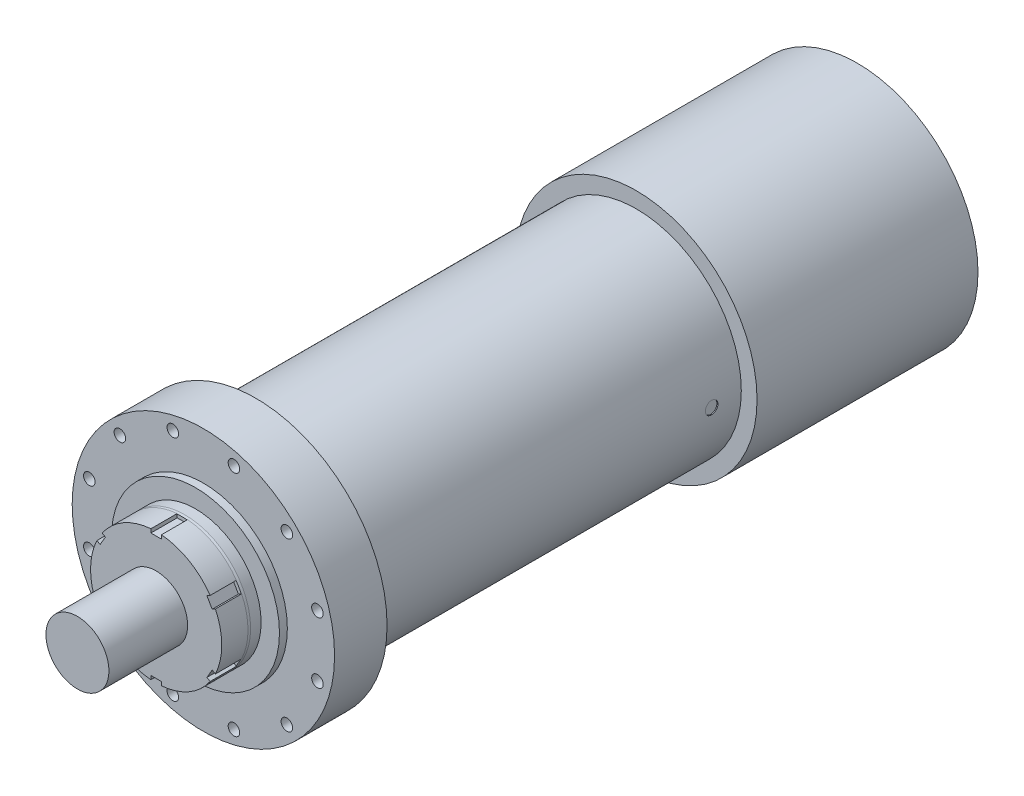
ISO-10303-21;
HEADER;
FILE_DESCRIPTION(('STEP AP214'),'2;1');
FILE_NAME('part.step','',(''),(''),'','','');
FILE_SCHEMA(('AUTOMOTIVE_DESIGN { 1 0 10303 214 1 1 1 1 }'));
ENDSEC;
DATA;
#1=APPLICATION_CONTEXT('core data for automotive mechanical design processes');
#2=APPLICATION_PROTOCOL_DEFINITION('international standard','automotive_design',2000,#1);
#3=PRODUCT_CONTEXT('',#1,'mechanical');
#4=PRODUCT('Part','Part','',(#3));
#5=PRODUCT_RELATED_PRODUCT_CATEGORY('part','',(#4));
#6=PRODUCT_DEFINITION_FORMATION('','',#4);
#7=PRODUCT_DEFINITION_CONTEXT('part definition',#1,'design');
#8=PRODUCT_DEFINITION('design','',#6,#7);
#9=PRODUCT_DEFINITION_SHAPE('','',#8);
#10=(LENGTH_UNIT() NAMED_UNIT(*) SI_UNIT(.MILLI.,.METRE.));
#11=(NAMED_UNIT(*) PLANE_ANGLE_UNIT() SI_UNIT($,.RADIAN.));
#12=(NAMED_UNIT(*) SI_UNIT($,.STERADIAN.) SOLID_ANGLE_UNIT());
#13=UNCERTAINTY_MEASURE_WITH_UNIT(LENGTH_MEASURE(1.E-05),#10,'distance_accuracy_value','');
#14=(GEOMETRIC_REPRESENTATION_CONTEXT(3) GLOBAL_UNCERTAINTY_ASSIGNED_CONTEXT((#13)) GLOBAL_UNIT_ASSIGNED_CONTEXT((#10,
#11,#12)) REPRESENTATION_CONTEXT('',''));
#15=CARTESIAN_POINT('',(0.,0.,0.));
#16=DIRECTION('',(0.,0.,1.));
#17=DIRECTION('',(1.,0.,0.));
#18=AXIS2_PLACEMENT_3D('',#15,#16,#17);
#19=CARTESIAN_POINT('',(0.,0.,865.));
#20=DIRECTION('',(0.,0.,1.));
#21=DIRECTION('',(1.,0.,0.));
#22=AXIS2_PLACEMENT_3D('',#19,#20,#21);
#23=PLANE('',#22);
#24=DIRECTION('',(0.866025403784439,-0.5,0.));
#25=VECTOR('',#24,1.);
#26=CARTESIAN_POINT('',(112.906209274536,-53.6394249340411,865.));
#27=LINE('',#26,#25);
#28=CARTESIAN_POINT('',(106.757984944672,-50.0897459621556,865.));
#29=VERTEX_POINT('',#28);
#30=CARTESIAN_POINT('',(112.140218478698,-53.1971799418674,865.));
#31=VERTEX_POINT('',#30);
#32=EDGE_CURVE('E61',#29,#31,#27,.T.);
#33=ORIENTED_EDGE('',*,*,#32,.F.);
#34=DIRECTION('',(0.5,0.866025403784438,0.));
#35=VECTOR('',#34,1.);
#36=CARTESIAN_POINT('',(106.757984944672,-50.0897459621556,865.));
#37=LINE('',#36,#35);
#38=CARTESIAN_POINT('',(96.7579849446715,-67.4102540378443,865.));
#39=VERTEX_POINT('',#38);
#40=EDGE_CURVE('E65',#39,#29,#37,.T.);
#41=ORIENTED_EDGE('',*,*,#40,.F.);
#42=DIRECTION('',(-0.866025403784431,0.500000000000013,0.));
#43=VECTOR('',#42,1.);
#44=CARTESIAN_POINT('',(96.7579849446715,-67.4102540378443,865.));
#45=LINE('',#44,#43);
#46=CARTESIAN_POINT('',(102.140218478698,-70.5176880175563,865.));
#47=VERTEX_POINT('',#46);
#48=EDGE_CURVE('E53',#47,#39,#45,.T.);
#49=ORIENTED_EDGE('',*,*,#48,.F.);
#50=CARTESIAN_POINT('',(0.,0.,865.));
#51=DIRECTION('',(0.,0.,1.));
#52=DIRECTION('',(1.,0.,0.));
#53=AXIS2_PLACEMENT_3D('',#50,#51,#52);
#54=CIRCLE('',#53,124.118365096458);
#55=EDGE_CURVE('E776',#47,#31,#54,.T.);
#56=ORIENTED_EDGE('',*,*,#55,.T.);
#57=EDGE_LOOP('',(#33,#41,#49,#56));
#58=FACE_BOUND('',#57,.T.);
#59=ADVANCED_FACE('F39',(#58),#23,.T.);
#60=DIRECTION('',(0.,-1.,0.));
#61=VECTOR('',#60,1.);
#62=CARTESIAN_POINT('',(10.,-124.599357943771,865.));
#63=LINE('',#62,#61);
#64=CARTESIAN_POINT('',(10.,-117.5,865.));
#65=VERTEX_POINT('',#64);
#66=CARTESIAN_POINT('',(10.,-123.714867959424,865.));
#67=VERTEX_POINT('',#66);
#68=EDGE_CURVE('E558',#65,#67,#63,.T.);
#69=ORIENTED_EDGE('',*,*,#68,.F.);
#70=DIRECTION('',(1.,0.,0.));
#71=VECTOR('',#70,1.);
#72=CARTESIAN_POINT('',(10.,-117.5,865.));
#73=LINE('',#72,#71);
#74=CARTESIAN_POINT('',(-9.99999999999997,-117.5,865.));
#75=VERTEX_POINT('',#74);
#76=EDGE_CURVE('E560',#75,#65,#73,.T.);
#77=ORIENTED_EDGE('',*,*,#76,.F.);
#78=DIRECTION('',(0.,1.,0.));
#79=VECTOR('',#78,1.);
#80=CARTESIAN_POINT('',(-9.99999999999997,-117.5,865.));
#81=LINE('',#80,#79);
#82=CARTESIAN_POINT('',(-10.0000000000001,-123.714867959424,865.));
#83=VERTEX_POINT('',#82);
#84=EDGE_CURVE('E734',#83,#75,#81,.T.);
#85=ORIENTED_EDGE('',*,*,#84,.F.);
#86=EDGE_CURVE('E563',#83,#67,#54,.T.);
#87=ORIENTED_EDGE('',*,*,#86,.T.);
#88=EDGE_LOOP('',(#69,#77,#85,#87));
#89=FACE_BOUND('',#88,.T.);
#90=ADVANCED_FACE('F545',(#89),#23,.T.);
#91=DIRECTION('',(-0.866025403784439,-0.5,0.));
#92=VECTOR('',#91,1.);
#93=CARTESIAN_POINT('',(-102.906209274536,-70.95993300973,865.));
#94=LINE('',#93,#92);
#95=CARTESIAN_POINT('',(-96.7579849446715,-67.4102540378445,865.));
#96=VERTEX_POINT('',#95);
#97=CARTESIAN_POINT('',(-102.140218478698,-70.5176880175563,865.));
#98=VERTEX_POINT('',#97);
#99=EDGE_CURVE('E725',#96,#98,#94,.T.);
#100=ORIENTED_EDGE('',*,*,#99,.F.);
#101=DIRECTION('',(0.5,-0.866025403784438,0.));
#102=VECTOR('',#101,1.);
#103=CARTESIAN_POINT('',(-96.7579849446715,-67.4102540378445,865.));
#104=LINE('',#103,#102);
#105=CARTESIAN_POINT('',(-106.757984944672,-50.0897459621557,865.));
#106=VERTEX_POINT('',#105);
#107=EDGE_CURVE('E719',#106,#96,#104,.T.);
#108=ORIENTED_EDGE('',*,*,#107,.F.);
#109=DIRECTION('',(0.866025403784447,0.499999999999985,0.));
#110=VECTOR('',#109,1.);
#111=CARTESIAN_POINT('',(-106.757984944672,-50.0897459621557,865.));
#112=LINE('',#111,#110);
#113=CARTESIAN_POINT('',(-112.140218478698,-53.1971799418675,865.));
#114=VERTEX_POINT('',#113);
#115=EDGE_CURVE('E720',#114,#106,#112,.T.);
#116=ORIENTED_EDGE('',*,*,#115,.F.);
#117=EDGE_CURVE('E962',#114,#98,#54,.T.);
#118=ORIENTED_EDGE('',*,*,#117,.T.);
#119=EDGE_LOOP('',(#100,#108,#116,#118));
#120=FACE_BOUND('',#119,.T.);
#121=ADVANCED_FACE('F549',(#120),#23,.T.);
#122=DIRECTION('',(-0.86602540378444,0.499999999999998,0.));
#123=VECTOR('',#122,1.);
#124=CARTESIAN_POINT('',(-112.906209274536,53.6394249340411,865.));
#125=LINE('',#124,#123);
#126=CARTESIAN_POINT('',(-106.757984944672,50.0897459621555,865.));
#127=VERTEX_POINT('',#126);
#128=CARTESIAN_POINT('',(-112.140218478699,53.1971799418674,865.));
#129=VERTEX_POINT('',#128);
#130=EDGE_CURVE('E708',#127,#129,#125,.T.);
#131=ORIENTED_EDGE('',*,*,#130,.F.);
#132=DIRECTION('',(-0.500000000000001,-0.866025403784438,0.));
#133=VECTOR('',#132,1.);
#134=CARTESIAN_POINT('',(-106.757984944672,50.0897459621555,865.));
#135=LINE('',#134,#133);
#136=CARTESIAN_POINT('',(-96.7579849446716,67.4102540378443,865.));
#137=VERTEX_POINT('',#136);
#138=EDGE_CURVE('E702',#137,#127,#135,.T.);
#139=ORIENTED_EDGE('',*,*,#138,.F.);
#140=DIRECTION('',(0.866025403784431,-0.500000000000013,0.));
#141=VECTOR('',#140,1.);
#142=CARTESIAN_POINT('',(-96.7579849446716,67.4102540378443,865.));
#143=LINE('',#142,#141);
#144=CARTESIAN_POINT('',(-102.140218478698,70.5176880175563,865.));
#145=VERTEX_POINT('',#144);
#146=EDGE_CURVE('E703',#145,#137,#143,.T.);
#147=ORIENTED_EDGE('',*,*,#146,.F.);
#148=EDGE_CURVE('E956',#145,#129,#54,.T.);
#149=ORIENTED_EDGE('',*,*,#148,.T.);
#150=EDGE_LOOP('',(#131,#139,#147,#149));
#151=FACE_BOUND('',#150,.T.);
#152=ADVANCED_FACE('F554',(#151),#23,.T.);
#153=DIRECTION('',(0.,1.,0.));
#154=VECTOR('',#153,1.);
#155=CARTESIAN_POINT('',(-10.,124.599357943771,865.));
#156=LINE('',#155,#154);
#157=CARTESIAN_POINT('',(-10.,117.5,865.));
#158=VERTEX_POINT('',#157);
#159=CARTESIAN_POINT('',(-10.,123.714867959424,865.));
#160=VERTEX_POINT('',#159);
#161=EDGE_CURVE('E691',#158,#160,#156,.T.);
#162=ORIENTED_EDGE('',*,*,#161,.F.);
#163=DIRECTION('',(-1.,0.,0.));
#164=VECTOR('',#163,1.);
#165=CARTESIAN_POINT('',(-10.,117.5,865.));
#166=LINE('',#165,#164);
#167=CARTESIAN_POINT('',(9.99999999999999,117.5,865.));
#168=VERTEX_POINT('',#167);
#169=EDGE_CURVE('E685',#168,#158,#166,.T.);
#170=ORIENTED_EDGE('',*,*,#169,.F.);
#171=DIRECTION('',(0.,-1.,0.));
#172=VECTOR('',#171,1.);
#173=CARTESIAN_POINT('',(9.99999999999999,117.5,865.));
#174=LINE('',#173,#172);
#175=CARTESIAN_POINT('',(9.99999999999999,123.714867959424,865.));
#176=VERTEX_POINT('',#175);
#177=EDGE_CURVE('E686',#176,#168,#174,.T.);
#178=ORIENTED_EDGE('',*,*,#177,.F.);
#179=EDGE_CURVE('E858',#176,#160,#54,.T.);
#180=ORIENTED_EDGE('',*,*,#179,.T.);
#181=EDGE_LOOP('',(#162,#170,#178,#180));
#182=FACE_BOUND('',#181,.T.);
#183=ADVANCED_FACE('F470',(#182),#23,.T.);
#184=CARTESIAN_POINT('',(0.,0.,725.));
#185=DIRECTION('',(0.,0.,-1.));
#186=DIRECTION('',(-1.,0.,0.));
#187=AXIS2_PLACEMENT_3D('',#184,#185,#186);
#188=CYLINDRICAL_SURFACE('',#187,200.);
#189=CARTESIAN_POINT('',(200.,0.,44.5));
#190=CARTESIAN_POINT('',(200.000000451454,-0.336818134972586,44.4999972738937));
#191=CARTESIAN_POINT('',(199.999147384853,-0.673592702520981,44.5141864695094));
#192=CARTESIAN_POINT('',(199.995759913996,-1.34485594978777,44.5708419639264));
#193=CARTESIAN_POINT('',(199.993225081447,-1.67934402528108,44.6133154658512));
#194=CARTESIAN_POINT('',(199.986541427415,-2.34388649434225,44.7263038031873));
#195=CARTESIAN_POINT('',(199.982390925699,-2.67393590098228,44.7968478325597));
#196=CARTESIAN_POINT('',(199.97259396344,-3.32690256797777,44.9654685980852));
#197=CARTESIAN_POINT('',(199.966947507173,-3.64981984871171,45.063545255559));
#198=CARTESIAN_POINT('',(199.95432206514,-4.28605714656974,45.2864689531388));
#199=CARTESIAN_POINT('',(199.947343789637,-4.59938217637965,45.411301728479));
#200=CARTESIAN_POINT('',(199.932250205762,-5.21439925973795,45.6868788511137));
#201=CARTESIAN_POINT('',(199.92413488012,-5.51609113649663,45.837623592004));
#202=CARTESIAN_POINT('',(199.906998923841,-6.10563167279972,46.1639107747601));
#203=CARTESIAN_POINT('',(199.897978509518,-6.39348361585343,46.3394472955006));
#204=CARTESIAN_POINT('',(199.879285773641,-6.95338726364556,46.7140984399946));
#205=CARTESIAN_POINT('',(199.869613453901,-7.22543901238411,46.9132129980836));
#206=CARTESIAN_POINT('',(199.84987810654,-7.75214646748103,47.3338690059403));
#207=CARTESIAN_POINT('',(199.839814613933,-8.00678041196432,47.555437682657));
#208=CARTESIAN_POINT('',(199.819593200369,-8.49648428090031,48.0192286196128));
#209=CARTESIAN_POINT('',(199.809435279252,-8.73155417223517,48.2614509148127));
#210=CARTESIAN_POINT('',(199.789312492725,-9.18047473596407,48.7648450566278));
#211=CARTESIAN_POINT('',(199.779347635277,-9.39432453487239,49.0260176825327));
#212=CARTESIAN_POINT('',(199.759894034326,-9.79927768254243,49.5654558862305));
#213=CARTESIAN_POINT('',(199.750405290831,-9.99038103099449,49.8437214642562));
#214=CARTESIAN_POINT('',(199.732166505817,-10.3486167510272,50.4155890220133));
#215=CARTESIAN_POINT('',(199.723417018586,-10.5157312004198,50.7092022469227));
#216=CARTESIAN_POINT('',(199.706913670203,-10.8246278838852,51.3094920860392));
#217=CARTESIAN_POINT('',(199.699159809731,-10.9664101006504,51.6161687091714));
#218=CARTESIAN_POINT('',(199.684868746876,-11.2236267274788,52.2404038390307));
#219=CARTESIAN_POINT('',(199.678331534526,-11.3390613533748,52.5579622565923));
#220=CARTESIAN_POINT('',(199.666660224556,-11.5427558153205,53.2017032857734));
#221=CARTESIAN_POINT('',(199.661526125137,-11.631015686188,53.5278858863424));
#222=CARTESIAN_POINT('',(199.652812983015,-11.7796353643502,54.1861499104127));
#223=CARTESIAN_POINT('',(199.649232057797,-11.8400289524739,54.5182236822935));
#224=CARTESIAN_POINT('',(199.643718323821,-11.9326397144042,55.1862908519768));
#225=CARTESIAN_POINT('',(199.641785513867,-11.9648569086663,55.5222842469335));
#226=CARTESIAN_POINT('',(199.639623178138,-12.0008826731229,56.1957928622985));
#227=CARTESIAN_POINT('',(199.639393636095,-12.0046915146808,56.5333080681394));
#228=CARTESIAN_POINT('',(199.640644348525,-11.9838738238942,57.207457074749));
#229=CARTESIAN_POINT('',(199.642124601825,-11.9592473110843,57.5440908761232));
#230=CARTESIAN_POINT('',(199.646749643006,-11.881786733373,58.2136429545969));
#231=CARTESIAN_POINT('',(199.649892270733,-11.8289892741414,58.5465654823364));
#232=CARTESIAN_POINT('',(199.657751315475,-11.6955888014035,59.2067729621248));
#233=CARTESIAN_POINT('',(199.662467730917,-11.6149858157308,59.5340579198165));
#234=CARTESIAN_POINT('',(199.673340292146,-11.4265512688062,60.1806698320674));
#235=CARTESIAN_POINT('',(199.679496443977,-11.3187195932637,60.4999967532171));
#236=CARTESIAN_POINT('',(199.693073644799,-11.0765982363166,61.1284294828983));
#237=CARTESIAN_POINT('',(199.700494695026,-10.9423085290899,61.4375352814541));
#238=CARTESIAN_POINT('',(199.716396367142,-10.6481322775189,62.0435365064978));
#239=CARTESIAN_POINT('',(199.724877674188,-10.4882291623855,62.340423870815));
#240=CARTESIAN_POINT('',(199.742655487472,-10.1440259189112,62.9196760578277));
#241=CARTESIAN_POINT('',(199.75195199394,-9.95972578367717,63.2020408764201));
#242=CARTESIAN_POINT('',(199.771096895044,-9.5680341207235,63.7502561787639));
#243=CARTESIAN_POINT('',(199.780945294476,-9.36064239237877,64.0161065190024));
#244=CARTESIAN_POINT('',(199.800915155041,-8.92423659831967,64.529413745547));
#245=CARTESIAN_POINT('',(199.811036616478,-8.69522250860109,64.7768706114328));
#246=CARTESIAN_POINT('',(199.831282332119,-8.2168118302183,65.2520193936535));
#247=CARTESIAN_POINT('',(199.841406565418,-7.96738357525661,65.4796794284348));
#248=CARTESIAN_POINT('',(199.861354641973,-7.45022594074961,65.9131810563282));
#249=CARTESIAN_POINT('',(199.871178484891,-7.18249654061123,66.1190226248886));
#250=CARTESIAN_POINT('',(199.890247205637,-6.63063236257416,66.5074255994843));
#251=CARTESIAN_POINT('',(199.899492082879,-6.34649756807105,66.6899869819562));
#252=CARTESIAN_POINT('',(199.917140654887,-5.76383629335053,67.0305297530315));
#253=CARTESIAN_POINT('',(199.92554435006,-5.46530982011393,67.1885111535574));
#254=CARTESIAN_POINT('',(199.94127250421,-4.85596814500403,67.4787734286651));
#255=CARTESIAN_POINT('',(199.94859691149,-4.54515235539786,67.6110530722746));
#256=CARTESIAN_POINT('',(199.961958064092,-3.91345386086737,67.8489554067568));
#257=CARTESIAN_POINT('',(199.967994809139,-3.5925711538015,67.9545780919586));
#258=CARTESIAN_POINT('',(199.978609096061,-2.94302558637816,68.138407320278));
#259=CARTESIAN_POINT('',(199.983186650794,-2.61436279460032,68.2166141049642));
#260=CARTESIAN_POINT('',(199.990752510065,-1.95159736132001,68.3450498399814));
#261=CARTESIAN_POINT('',(199.993740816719,-1.61749472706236,68.3952788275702));
#262=CARTESIAN_POINT('',(199.998039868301,-0.946756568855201,68.467340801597));
#263=CARTESIAN_POINT('',(199.999353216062,-0.610125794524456,68.489217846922));
#264=CARTESIAN_POINT('',(200.000273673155,0.0637847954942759,68.5045628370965));
#265=CARTESIAN_POINT('',(199.999880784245,0.40106461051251,68.4980308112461));
#266=CARTESIAN_POINT('',(199.997399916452,1.07386998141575,68.4566048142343));
#267=CARTESIAN_POINT('',(199.995311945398,1.4093955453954,68.4217109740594));
#268=CARTESIAN_POINT('',(199.98950012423,2.07630576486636,68.3238125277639));
#269=CARTESIAN_POINT('',(199.985776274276,2.4076904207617,68.2608079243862));
#270=CARTESIAN_POINT('',(199.976801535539,3.06372180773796,68.1071968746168));
#271=CARTESIAN_POINT('',(199.971551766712,3.38837329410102,68.0166106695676));
#272=CARTESIAN_POINT('',(199.959672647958,4.02888618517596,67.8084689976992));
#273=CARTESIAN_POINT('',(199.953043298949,4.34474759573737,67.6909135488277));
#274=CARTESIAN_POINT('',(199.938592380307,4.96544648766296,67.4296715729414));
#275=CARTESIAN_POINT('',(199.930770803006,5.27028389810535,67.2859848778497));
#276=CARTESIAN_POINT('',(199.914156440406,5.86677844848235,66.973503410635));
#277=CARTESIAN_POINT('',(199.905363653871,6.15843557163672,66.8047086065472));
#278=CARTESIAN_POINT('',(199.887043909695,6.72686049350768,66.4429862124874));
#279=CARTESIAN_POINT('',(199.877516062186,7.00360953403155,66.2500291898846));
#280=CARTESIAN_POINT('',(199.85800533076,7.53987480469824,65.8415150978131));
#281=CARTESIAN_POINT('',(199.84802244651,7.79939102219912,65.6259580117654));
#282=CARTESIAN_POINT('',(199.827884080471,8.29935868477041,65.1737683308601));
#283=CARTESIAN_POINT('',(199.817728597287,8.53980997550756,64.9371355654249));
#284=CARTESIAN_POINT('',(199.797532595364,8.99994549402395,64.4444693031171));
#285=CARTESIAN_POINT('',(199.787492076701,9.21962970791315,64.1884357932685));
#286=CARTESIAN_POINT('',(199.767797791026,9.63694312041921,63.6584379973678));
#287=CARTESIAN_POINT('',(199.758144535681,9.83454371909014,63.3844511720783));
#288=CARTESIAN_POINT('',(199.739512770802,10.205960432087,62.8207823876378));
#289=CARTESIAN_POINT('',(199.730534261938,10.3797765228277,62.5311004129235));
#290=CARTESIAN_POINT('',(199.713507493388,10.7023843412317,61.9380971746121));
#291=CARTESIAN_POINT('',(199.70545922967,10.8511761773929,61.6347759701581));
#292=CARTESIAN_POINT('',(199.690522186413,11.1226725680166,61.0166473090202));
#293=CARTESIAN_POINT('',(199.683633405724,11.245377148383,60.7018398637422));
#294=CARTESIAN_POINT('',(199.671215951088,11.463746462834,60.0631910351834));
#295=CARTESIAN_POINT('',(199.665686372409,11.5594291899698,59.7393558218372));
#296=CARTESIAN_POINT('',(199.656139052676,11.7231767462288,59.0847544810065));
#297=CARTESIAN_POINT('',(199.652121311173,11.7912415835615,58.7539883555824));
#298=CARTESIAN_POINT('',(199.645712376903,11.8992631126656,58.0878845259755));
#299=CARTESIAN_POINT('',(199.643321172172,11.9392200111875,57.7525468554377));
#300=CARTESIAN_POINT('',(199.640233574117,11.99073839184,57.079689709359));
#301=CARTESIAN_POINT('',(199.639537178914,12.0022999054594,56.7421702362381));
#302=CARTESIAN_POINT('',(199.639858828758,11.9969484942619,56.0678915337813));
#303=CARTESIAN_POINT('',(199.640874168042,11.9800805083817,55.731131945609));
#304=CARTESIAN_POINT('',(199.644585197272,11.9180771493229,55.0602348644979));
#305=CARTESIAN_POINT('',(199.647280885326,11.8729418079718,54.7260973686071));
#306=CARTESIAN_POINT('',(199.654275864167,11.754727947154,54.0628194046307));
#307=CARTESIAN_POINT('',(199.658575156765,11.6816493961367,53.7336789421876));
#308=CARTESIAN_POINT('',(199.668655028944,11.5080731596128,53.0827324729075));
#309=CARTESIAN_POINT('',(199.674435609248,11.4075754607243,52.7609264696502));
#310=CARTESIAN_POINT('',(199.687313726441,11.1798805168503,52.1269324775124));
#311=CARTESIAN_POINT('',(199.694411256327,11.0526834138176,51.814744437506));
#312=CARTESIAN_POINT('',(199.709721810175,10.7724967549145,51.2021943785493));
#313=CARTESIAN_POINT('',(199.71793483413,10.6195071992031,50.901832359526));
#314=CARTESIAN_POINT('',(199.735243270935,10.2888285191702,50.3150654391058));
#315=CARTESIAN_POINT('',(199.744338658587,10.1111401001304,50.028660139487));
#316=CARTESIAN_POINT('',(199.763154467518,9.73232068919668,49.4718189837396));
#317=CARTESIAN_POINT('',(199.772874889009,9.53118968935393,49.201383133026));
#318=CARTESIAN_POINT('',(199.792680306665,9.10659722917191,48.678005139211));
#319=CARTESIAN_POINT('',(199.802765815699,8.88310351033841,48.4250891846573));
#320=CARTESIAN_POINT('',(199.823002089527,8.41561396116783,47.9389745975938));
#321=CARTESIAN_POINT('',(199.833152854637,8.17161803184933,47.7057760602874));
#322=CARTESIAN_POINT('',(199.853234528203,7.66478752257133,47.2606924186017));
#323=CARTESIAN_POINT('',(199.863165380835,7.40194822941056,47.0488126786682));
#324=CARTESIAN_POINT('',(199.882523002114,6.8593497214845,46.6479393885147));
#325=CARTESIAN_POINT('',(199.891949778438,6.57959076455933,46.4589454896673));
#326=CARTESIAN_POINT('',(199.910042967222,6.00478830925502,46.1049735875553));
#327=CARTESIAN_POINT('',(199.918708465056,5.7097270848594,45.9400243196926));
#328=CARTESIAN_POINT('',(199.935020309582,5.10672265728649,45.6355873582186));
#329=CARTESIAN_POINT('',(199.942666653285,4.79877941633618,45.4960997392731));
#330=CARTESIAN_POINT('',(199.95671533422,4.17252410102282,45.243718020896));
#331=CARTESIAN_POINT('',(199.96311897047,3.85422326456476,45.1307961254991));
#332=CARTESIAN_POINT('',(199.974509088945,3.20932132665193,44.9321958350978));
#333=CARTESIAN_POINT('',(199.979495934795,2.88272237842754,44.8465104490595));
#334=CARTESIAN_POINT('',(199.989051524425,2.13414018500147,44.6835216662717));
#335=CARTESIAN_POINT('',(199.99314188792,1.71026312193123,44.6147621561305));
#336=CARTESIAN_POINT('',(199.998615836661,0.857567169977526,44.5230030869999));
#337=CARTESIAN_POINT('',(199.999999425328,0.428748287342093,44.5000034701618));
#338=CARTESIAN_POINT('',(200.,0.,44.5));
#339=B_SPLINE_CURVE_WITH_KNOTS('',3,(#189,#190,#191,#192,#193,#194,#195,#196,#197,#198,#199,
#200,#201,#202,#203,#204,#205,#206,#207,#208,#209,#210,#211,#212,#213,#214,#215,#216,#217,#218,
#219,#220,#221,#222,#223,#224,#225,#226,#227,#228,#229,#230,#231,#232,#233,#234,#235,#236,#237,
#238,#239,#240,#241,#242,#243,#244,#245,#246,#247,#248,#249,#250,#251,#252,#253,#254,#255,#256,
#257,#258,#259,#260,#261,#262,#263,#264,#265,#266,#267,#268,#269,#270,#271,#272,#273,#274,#275,
#276,#277,#278,#279,#280,#281,#282,#283,#284,#285,#286,#287,#288,#289,#290,#291,#292,#293,#294,
#295,#296,#297,#298,#299,#300,#301,#302,#303,#304,#305,#306,#307,#308,#309,#310,#311,#312,#313,
#314,#315,#316,#317,#318,#319,#320,#321,#322,#323,#324,#325,#326,#327,#328,#329,#330,#331,#332,
#333,#334,#335,#336,#337,#338),.UNSPECIFIED.,.T.,.F.,(4,2,2,2,2,2,2,2,2,2,2,2,2,2,2,2,2,2,2,2,2,
2,2,2,2,2,2,2,2,2,2,2,2,2,2,2,2,2,2,2,2,2,2,2,2,2,2,2,2,2,2,2,2,2,2,2,2,2,2,2,2,2,2,2,2,2,2,2,2,
2,2,2,2,2,4),(0.,1.01007974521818,2.02041682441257,3.03180743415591,4.04319515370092,
5.0540449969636,6.06491019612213,7.07553437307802,8.08615573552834,9.09801754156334,
10.1098810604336,11.1217862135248,12.1336913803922,13.1463486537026,14.1590066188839,
15.171656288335,16.1843046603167,17.1957222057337,18.207139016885,19.2185461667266,
20.2299526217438,21.2400480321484,22.250142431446,23.2602410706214,24.2703406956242,
25.2810964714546,26.2918525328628,27.3026173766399,28.3133833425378,29.3257480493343,
30.3381138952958,31.350480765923,32.3628471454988,33.3752619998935,34.3876770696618,
35.4000832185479,36.4124880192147,37.4233176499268,38.4341462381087,39.444970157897,
40.4557939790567,41.4658777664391,42.4759608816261,43.4860504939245,44.4961413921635,
45.5074749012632,46.5188091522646,47.5301515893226,48.5414947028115,49.5541327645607,
50.566771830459,51.5794065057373,52.5920401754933,53.6039979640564,54.6159554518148,
55.6279054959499,56.6398544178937,57.650205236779,58.6605549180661,59.6709057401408,
60.6812570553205,61.6916029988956,62.7019489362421,63.7122660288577,64.7225834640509,
65.7343799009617,66.7461812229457,67.75823651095,68.7702763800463,69.7835159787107,
70.7967585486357,71.8089361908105,72.8208538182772,74.1066233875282,75.3923913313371),.UNSPECIFIED.);
#340=CARTESIAN_POINT('',(200.,0.,44.5));
#341=VERTEX_POINT('',#340);
#342=EDGE_CURVE('E43',#341,#341,#339,.T.);
#343=ORIENTED_EDGE('',*,*,#342,.T.);
#344=EDGE_LOOP('',(#343));
#345=FACE_BOUND('',#344,.T.);
#346=CARTESIAN_POINT('',(0.,0.,725.));
#347=DIRECTION('',(0.,0.,1.));
#348=DIRECTION('',(1.,0.,0.));
#349=AXIS2_PLACEMENT_3D('',#346,#347,#348);
#350=CIRCLE('',#349,200.);
#351=CARTESIAN_POINT('',(200.,0.,725.));
#352=VERTEX_POINT('',#351);
#353=EDGE_CURVE('E303',#352,#352,#350,.T.);
#354=ORIENTED_EDGE('',*,*,#353,.F.);
#355=EDGE_LOOP('',(#354));
#356=FACE_BOUND('',#355,.T.);
#357=CARTESIAN_POINT('',(0.,0.,0.));
#358=DIRECTION('',(0.,0.,1.));
#359=DIRECTION('',(1.,0.,0.));
#360=AXIS2_PLACEMENT_3D('',#357,#358,#359);
#361=CIRCLE('',#360,200.);
#362=CARTESIAN_POINT('',(200.,0.,0.));
#363=VERTEX_POINT('',#362);
#364=EDGE_CURVE('E294',#363,#363,#361,.T.);
#365=ORIENTED_EDGE('',*,*,#364,.T.);
#366=EDGE_LOOP('',(#365));
#367=FACE_BOUND('',#366,.T.);
#368=CARTESIAN_POINT('',(-200.,0.,682.5));
#369=CARTESIAN_POINT('',(-200.000000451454,0.336818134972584,682.500002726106));
#370=CARTESIAN_POINT('',(-199.999147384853,0.673592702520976,682.485813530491));
#371=CARTESIAN_POINT('',(-199.995759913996,1.34485594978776,682.429158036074));
#372=CARTESIAN_POINT('',(-199.993225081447,1.67934402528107,682.386684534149));
#373=CARTESIAN_POINT('',(-199.986541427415,2.34388649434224,682.273696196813));
#374=CARTESIAN_POINT('',(-199.982390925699,2.67393590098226,682.20315216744));
#375=CARTESIAN_POINT('',(-199.97259396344,3.32690256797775,682.034531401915));
#376=CARTESIAN_POINT('',(-199.966947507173,3.64981984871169,681.936454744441));
#377=CARTESIAN_POINT('',(-199.95432206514,4.28605714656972,681.713531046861));
#378=CARTESIAN_POINT('',(-199.947343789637,4.59938217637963,681.588698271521));
#379=CARTESIAN_POINT('',(-199.932250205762,5.21439925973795,681.313121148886));
#380=CARTESIAN_POINT('',(-199.92413488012,5.51609113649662,681.162376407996));
#381=CARTESIAN_POINT('',(-199.906998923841,6.10563167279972,680.83608922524));
#382=CARTESIAN_POINT('',(-199.897978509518,6.39348361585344,680.660552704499));
#383=CARTESIAN_POINT('',(-199.879285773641,6.95338726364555,680.285901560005));
#384=CARTESIAN_POINT('',(-199.869613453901,7.22543901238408,680.086787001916));
#385=CARTESIAN_POINT('',(-199.84987810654,7.752146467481,679.66613099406));
#386=CARTESIAN_POINT('',(-199.839814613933,8.00678041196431,679.444562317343));
#387=CARTESIAN_POINT('',(-199.819593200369,8.49648428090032,678.980771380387));
#388=CARTESIAN_POINT('',(-199.809435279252,8.73155417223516,678.738549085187));
#389=CARTESIAN_POINT('',(-199.789312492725,9.18047473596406,678.235154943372));
#390=CARTESIAN_POINT('',(-199.779347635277,9.39432453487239,677.973982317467));
#391=CARTESIAN_POINT('',(-199.759894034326,9.79927768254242,677.434544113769));
#392=CARTESIAN_POINT('',(-199.750405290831,9.99038103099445,677.156278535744));
#393=CARTESIAN_POINT('',(-199.732166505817,10.3486167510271,676.584410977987));
#394=CARTESIAN_POINT('',(-199.723417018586,10.5157312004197,676.290797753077));
#395=CARTESIAN_POINT('',(-199.706913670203,10.8246278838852,675.690507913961));
#396=CARTESIAN_POINT('',(-199.699159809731,10.9664101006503,675.383831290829));
#397=CARTESIAN_POINT('',(-199.684868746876,11.2236267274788,674.759596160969));
#398=CARTESIAN_POINT('',(-199.678331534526,11.3390613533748,674.442037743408));
#399=CARTESIAN_POINT('',(-199.666660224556,11.5427558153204,673.798296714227));
#400=CARTESIAN_POINT('',(-199.661526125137,11.631015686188,673.472114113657));
#401=CARTESIAN_POINT('',(-199.652812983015,11.7796353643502,672.813850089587));
#402=CARTESIAN_POINT('',(-199.649232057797,11.8400289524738,672.481776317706));
#403=CARTESIAN_POINT('',(-199.643718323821,11.9326397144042,671.813709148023));
#404=CARTESIAN_POINT('',(-199.641785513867,11.9648569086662,671.477715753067));
#405=CARTESIAN_POINT('',(-199.639623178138,12.0008826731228,670.804207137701));
#406=CARTESIAN_POINT('',(-199.639393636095,12.0046915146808,670.466691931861));
#407=CARTESIAN_POINT('',(-199.640644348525,11.9838738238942,669.792542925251));
#408=CARTESIAN_POINT('',(-199.642124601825,11.9592473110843,669.455909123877));
#409=CARTESIAN_POINT('',(-199.646749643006,11.881786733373,668.786357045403));
#410=CARTESIAN_POINT('',(-199.649892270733,11.8289892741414,668.453434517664));
#411=CARTESIAN_POINT('',(-199.657751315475,11.6955888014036,667.793227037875));
#412=CARTESIAN_POINT('',(-199.662467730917,11.6149858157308,667.465942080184));
#413=CARTESIAN_POINT('',(-199.673340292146,11.4265512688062,666.819330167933));
#414=CARTESIAN_POINT('',(-199.679496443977,11.3187195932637,666.500003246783));
#415=CARTESIAN_POINT('',(-199.693073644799,11.0765982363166,665.871570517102));
#416=CARTESIAN_POINT('',(-199.700494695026,10.9423085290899,665.562464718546));
#417=CARTESIAN_POINT('',(-199.716396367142,10.6481322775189,664.956463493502));
#418=CARTESIAN_POINT('',(-199.724877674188,10.4882291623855,664.659576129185));
#419=CARTESIAN_POINT('',(-199.742655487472,10.1440259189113,664.080323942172));
#420=CARTESIAN_POINT('',(-199.75195199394,9.95972578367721,663.79795912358));
#421=CARTESIAN_POINT('',(-199.771096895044,9.56803412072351,663.249743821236));
#422=CARTESIAN_POINT('',(-199.780945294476,9.36064239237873,662.983893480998));
#423=CARTESIAN_POINT('',(-199.800915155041,8.9242365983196,662.470586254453));
#424=CARTESIAN_POINT('',(-199.811036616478,8.69522250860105,662.223129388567));
#425=CARTESIAN_POINT('',(-199.831282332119,8.21681183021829,661.747980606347));
#426=CARTESIAN_POINT('',(-199.841406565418,7.96738357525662,661.520320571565));
#427=CARTESIAN_POINT('',(-199.861354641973,7.45022594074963,661.086818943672));
#428=CARTESIAN_POINT('',(-199.871178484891,7.18249654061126,660.880977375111));
#429=CARTESIAN_POINT('',(-199.890247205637,6.6306323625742,660.492574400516));
#430=CARTESIAN_POINT('',(-199.899492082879,6.34649756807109,660.310013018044));
#431=CARTESIAN_POINT('',(-199.917140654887,5.76383629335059,659.969470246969));
#432=CARTESIAN_POINT('',(-199.92554435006,5.46530982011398,659.811488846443));
#433=CARTESIAN_POINT('',(-199.94127250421,4.85596814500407,659.521226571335));
#434=CARTESIAN_POINT('',(-199.94859691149,4.54515235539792,659.388946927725));
#435=CARTESIAN_POINT('',(-199.961958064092,3.91345386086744,659.151044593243));
#436=CARTESIAN_POINT('',(-199.967994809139,3.59257115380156,659.045421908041));
#437=CARTESIAN_POINT('',(-199.978609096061,2.9430255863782,658.861592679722));
#438=CARTESIAN_POINT('',(-199.983186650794,2.61436279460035,658.783385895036));
#439=CARTESIAN_POINT('',(-199.990752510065,1.95159736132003,658.654950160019));
#440=CARTESIAN_POINT('',(-199.993740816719,1.61749472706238,658.60472117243));
#441=CARTESIAN_POINT('',(-199.998039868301,0.946756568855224,658.532659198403));
#442=CARTESIAN_POINT('',(-199.999353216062,0.610125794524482,658.510782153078));
#443=CARTESIAN_POINT('',(-200.000273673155,-0.0637847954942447,658.495437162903));
#444=CARTESIAN_POINT('',(-199.999880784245,-0.401064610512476,658.501969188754));
#445=CARTESIAN_POINT('',(-199.997399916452,-1.07386998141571,658.543395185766));
#446=CARTESIAN_POINT('',(-199.995311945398,-1.40939554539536,658.578289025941));
#447=CARTESIAN_POINT('',(-199.98950012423,-2.07630576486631,658.676187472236));
#448=CARTESIAN_POINT('',(-199.985776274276,-2.40769042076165,658.739192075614));
#449=CARTESIAN_POINT('',(-199.976801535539,-3.06372180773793,658.892803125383));
#450=CARTESIAN_POINT('',(-199.971551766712,-3.38837329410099,658.983389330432));
#451=CARTESIAN_POINT('',(-199.959672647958,-4.02888618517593,659.191531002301));
#452=CARTESIAN_POINT('',(-199.953043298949,-4.34474759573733,659.309086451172));
#453=CARTESIAN_POINT('',(-199.938592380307,-4.96544648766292,659.570328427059));
#454=CARTESIAN_POINT('',(-199.930770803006,-5.27028389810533,659.71401512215));
#455=CARTESIAN_POINT('',(-199.914156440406,-5.86677844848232,660.026496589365));
#456=CARTESIAN_POINT('',(-199.905363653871,-6.15843557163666,660.195291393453));
#457=CARTESIAN_POINT('',(-199.887043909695,-6.7268604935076,660.557013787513));
#458=CARTESIAN_POINT('',(-199.877516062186,-7.00360953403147,660.749970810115));
#459=CARTESIAN_POINT('',(-199.85800533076,-7.53987480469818,661.158484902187));
#460=CARTESIAN_POINT('',(-199.84802244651,-7.79939102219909,661.374041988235));
#461=CARTESIAN_POINT('',(-199.827884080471,-8.29935868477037,661.82623166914));
#462=CARTESIAN_POINT('',(-199.817728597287,-8.53980997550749,662.062864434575));
#463=CARTESIAN_POINT('',(-199.797532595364,-8.9999454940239,662.555530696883));
#464=CARTESIAN_POINT('',(-199.787492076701,-9.21962970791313,662.811564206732));
#465=CARTESIAN_POINT('',(-199.767797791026,-9.63694312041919,663.341562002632));
#466=CARTESIAN_POINT('',(-199.758144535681,-9.8345437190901,663.615548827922));
#467=CARTESIAN_POINT('',(-199.739512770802,-10.205960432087,664.179217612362));
#468=CARTESIAN_POINT('',(-199.730534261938,-10.3797765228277,664.468899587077));
#469=CARTESIAN_POINT('',(-199.713507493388,-10.7023843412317,665.061902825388));
#470=CARTESIAN_POINT('',(-199.70545922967,-10.8511761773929,665.365224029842));
#471=CARTESIAN_POINT('',(-199.690522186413,-11.1226725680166,665.98335269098));
#472=CARTESIAN_POINT('',(-199.683633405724,-11.245377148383,666.298160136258));
#473=CARTESIAN_POINT('',(-199.671215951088,-11.4637464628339,666.936808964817));
#474=CARTESIAN_POINT('',(-199.665686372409,-11.5594291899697,667.260644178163));
#475=CARTESIAN_POINT('',(-199.656139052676,-11.7231767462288,667.915245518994));
#476=CARTESIAN_POINT('',(-199.652121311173,-11.7912415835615,668.246011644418));
#477=CARTESIAN_POINT('',(-199.645712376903,-11.8992631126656,668.912115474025));
#478=CARTESIAN_POINT('',(-199.643321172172,-11.9392200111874,669.247453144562));
#479=CARTESIAN_POINT('',(-199.640233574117,-11.99073839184,669.920310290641));
#480=CARTESIAN_POINT('',(-199.639537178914,-12.0022999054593,670.257829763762));
#481=CARTESIAN_POINT('',(-199.639858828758,-11.9969484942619,670.932108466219));
#482=CARTESIAN_POINT('',(-199.640874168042,-11.9800805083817,671.268868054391));
#483=CARTESIAN_POINT('',(-199.644585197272,-11.9180771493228,671.939765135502));
#484=CARTESIAN_POINT('',(-199.647280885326,-11.8729418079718,672.273902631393));
#485=CARTESIAN_POINT('',(-199.654275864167,-11.754727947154,672.937180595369));
#486=CARTESIAN_POINT('',(-199.658575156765,-11.6816493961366,673.266321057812));
#487=CARTESIAN_POINT('',(-199.668655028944,-11.5080731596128,673.917267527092));
#488=CARTESIAN_POINT('',(-199.674435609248,-11.4075754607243,674.23907353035));
#489=CARTESIAN_POINT('',(-199.687313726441,-11.1798805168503,674.873067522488));
#490=CARTESIAN_POINT('',(-199.694411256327,-11.0526834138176,675.185255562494));
#491=CARTESIAN_POINT('',(-199.709721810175,-10.7724967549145,675.797805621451));
#492=CARTESIAN_POINT('',(-199.71793483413,-10.6195071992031,676.098167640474));
#493=CARTESIAN_POINT('',(-199.735243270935,-10.2888285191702,676.684934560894));
#494=CARTESIAN_POINT('',(-199.744338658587,-10.1111401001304,676.971339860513));
#495=CARTESIAN_POINT('',(-199.763154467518,-9.73232068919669,677.52818101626));
#496=CARTESIAN_POINT('',(-199.772874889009,-9.53118968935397,677.798616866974));
#497=CARTESIAN_POINT('',(-199.792680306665,-9.10659722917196,678.321994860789));
#498=CARTESIAN_POINT('',(-199.802765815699,-8.88310351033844,678.574910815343));
#499=CARTESIAN_POINT('',(-199.823002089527,-8.41561396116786,679.061025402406));
#500=CARTESIAN_POINT('',(-199.833152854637,-8.17161803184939,679.294223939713));
#501=CARTESIAN_POINT('',(-199.853234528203,-7.66478752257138,679.739307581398));
#502=CARTESIAN_POINT('',(-199.863165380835,-7.40194822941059,679.951187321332));
#503=CARTESIAN_POINT('',(-199.882523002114,-6.8593497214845,680.352060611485));
#504=CARTESIAN_POINT('',(-199.891949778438,-6.57959076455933,680.541054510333));
#505=CARTESIAN_POINT('',(-199.910042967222,-6.00478830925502,680.895026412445));
#506=CARTESIAN_POINT('',(-199.918708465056,-5.7097270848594,681.059975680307));
#507=CARTESIAN_POINT('',(-199.935020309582,-5.10672265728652,681.364412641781));
#508=CARTESIAN_POINT('',(-199.942666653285,-4.79877941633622,681.503900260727));
#509=CARTESIAN_POINT('',(-199.95671533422,-4.17252410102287,681.756281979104));
#510=CARTESIAN_POINT('',(-199.96311897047,-3.85422326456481,681.869203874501));
#511=CARTESIAN_POINT('',(-199.974509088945,-3.20932132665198,682.067804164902));
#512=CARTESIAN_POINT('',(-199.979495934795,-2.8827223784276,682.15348955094));
#513=CARTESIAN_POINT('',(-199.989051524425,-2.13414018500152,682.316478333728));
#514=CARTESIAN_POINT('',(-199.99314188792,-1.71026312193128,682.38523784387));
#515=CARTESIAN_POINT('',(-199.998615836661,-0.857567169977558,682.476996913));
#516=CARTESIAN_POINT('',(-199.999999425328,-0.428748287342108,682.499996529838));
#517=CARTESIAN_POINT('',(-200.,0.,682.5));
#518=B_SPLINE_CURVE_WITH_KNOTS('',3,(#368,#369,#370,#371,#372,#373,#374,#375,#376,#377,#378,
#379,#380,#381,#382,#383,#384,#385,#386,#387,#388,#389,#390,#391,#392,#393,#394,#395,#396,#397,
#398,#399,#400,#401,#402,#403,#404,#405,#406,#407,#408,#409,#410,#411,#412,#413,#414,#415,#416,
#417,#418,#419,#420,#421,#422,#423,#424,#425,#426,#427,#428,#429,#430,#431,#432,#433,#434,#435,
#436,#437,#438,#439,#440,#441,#442,#443,#444,#445,#446,#447,#448,#449,#450,#451,#452,#453,#454,
#455,#456,#457,#458,#459,#460,#461,#462,#463,#464,#465,#466,#467,#468,#469,#470,#471,#472,#473,
#474,#475,#476,#477,#478,#479,#480,#481,#482,#483,#484,#485,#486,#487,#488,#489,#490,#491,#492,
#493,#494,#495,#496,#497,#498,#499,#500,#501,#502,#503,#504,#505,#506,#507,#508,#509,#510,#511,
#512,#513,#514,#515,#516,#517),.UNSPECIFIED.,.T.,.F.,(4,2,2,2,2,2,2,2,2,2,2,2,2,2,2,2,2,2,2,2,2,
2,2,2,2,2,2,2,2,2,2,2,2,2,2,2,2,2,2,2,2,2,2,2,2,2,2,2,2,2,2,2,2,2,2,2,2,2,2,2,2,2,2,2,2,2,2,2,2,
2,2,2,2,2,4),(0.,1.01007974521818,2.02041682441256,3.03180743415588,4.0431951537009,
5.05404499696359,6.06491019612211,7.07553437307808,8.08615573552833,9.09801754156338,
10.1098810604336,11.1217862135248,12.1336913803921,13.1463486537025,14.1590066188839,
15.1716562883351,16.1843046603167,17.1957222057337,18.207139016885,19.2185461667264,
20.2299526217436,21.2400480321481,22.2501424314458,23.2602410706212,24.270340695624,
25.2810964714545,26.2918525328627,27.3026173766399,28.3133833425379,29.3257480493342,
30.3381138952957,31.3504807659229,32.3628471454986,33.3752619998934,34.3876770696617,
35.4000832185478,36.4124880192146,37.4233176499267,38.4341462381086,39.4449701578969,
40.4557939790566,41.465877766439,42.475960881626,43.4860504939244,44.4961413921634,
45.507474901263,46.5188091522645,47.5301515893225,48.5414947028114,49.5541327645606,
50.5667718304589,51.5794065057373,52.5920401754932,53.6039979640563,54.6159554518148,
55.6279054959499,56.6398544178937,57.650205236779,58.660554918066,59.6709057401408,
60.6812570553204,61.6916029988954,62.701948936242,63.7122660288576,64.7225834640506,
65.7343799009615,66.7461812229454,67.7582365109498,68.7702763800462,69.7835159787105,
70.7967585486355,71.8089361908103,72.8208538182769,74.106623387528,75.392391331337),.UNSPECIFIED.);
#519=CARTESIAN_POINT('',(-200.,0.,682.5));
#520=VERTEX_POINT('',#519);
#521=EDGE_CURVE('E431',#520,#520,#518,.T.);
#522=ORIENTED_EDGE('',*,*,#521,.F.);
#523=EDGE_LOOP('',(#522));
#524=FACE_BOUND('',#523,.T.);
#525=CARTESIAN_POINT('',(-200.,0.,48.5));
#526=CARTESIAN_POINT('',(-200.000000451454,0.336818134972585,48.5000027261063));
#527=CARTESIAN_POINT('',(-199.999147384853,0.673592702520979,48.4858135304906));
#528=CARTESIAN_POINT('',(-199.995759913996,1.34485594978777,48.4291580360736));
#529=CARTESIAN_POINT('',(-199.993225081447,1.67934402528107,48.3866845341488));
#530=CARTESIAN_POINT('',(-199.986541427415,2.34388649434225,48.2736961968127));
#531=CARTESIAN_POINT('',(-199.982390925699,2.67393590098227,48.2031521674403));
#532=CARTESIAN_POINT('',(-199.97259396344,3.32690256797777,48.0345314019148));
#533=CARTESIAN_POINT('',(-199.966947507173,3.64981984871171,47.936454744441));
#534=CARTESIAN_POINT('',(-199.95432206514,4.28605714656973,47.7135310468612));
#535=CARTESIAN_POINT('',(-199.947343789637,4.59938217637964,47.588698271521));
#536=CARTESIAN_POINT('',(-199.932250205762,5.21439925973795,47.3131211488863));
#537=CARTESIAN_POINT('',(-199.92413488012,5.51609113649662,47.162376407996));
#538=CARTESIAN_POINT('',(-199.906998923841,6.10563167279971,46.8360892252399));
#539=CARTESIAN_POINT('',(-199.897978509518,6.39348361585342,46.6605527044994));
#540=CARTESIAN_POINT('',(-199.879285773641,6.95338726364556,46.2859015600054));
#541=CARTESIAN_POINT('',(-199.869613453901,7.22543901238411,46.0867870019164));
#542=CARTESIAN_POINT('',(-199.84987810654,7.75214646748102,45.6661309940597));
#543=CARTESIAN_POINT('',(-199.839814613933,8.00678041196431,45.4445623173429));
#544=CARTESIAN_POINT('',(-199.819593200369,8.4964842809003,44.9807713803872));
#545=CARTESIAN_POINT('',(-199.809435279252,8.73155417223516,44.7385490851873));
#546=CARTESIAN_POINT('',(-199.789312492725,9.18047473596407,44.2351549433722));
#547=CARTESIAN_POINT('',(-199.779347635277,9.39432453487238,43.9739823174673));
#548=CARTESIAN_POINT('',(-199.759894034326,9.79927768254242,43.4345441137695));
#549=CARTESIAN_POINT('',(-199.750405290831,9.99038103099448,43.1562785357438));
#550=CARTESIAN_POINT('',(-199.732166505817,10.3486167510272,42.5844109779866));
#551=CARTESIAN_POINT('',(-199.723417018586,10.5157312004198,42.2907977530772));
#552=CARTESIAN_POINT('',(-199.706913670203,10.8246278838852,41.6905079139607));
#553=CARTESIAN_POINT('',(-199.699159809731,10.9664101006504,41.3838312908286));
#554=CARTESIAN_POINT('',(-199.684868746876,11.2236267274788,40.7595961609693));
#555=CARTESIAN_POINT('',(-199.678331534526,11.3390613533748,40.4420377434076));
#556=CARTESIAN_POINT('',(-199.666660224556,11.5427558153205,39.7982967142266));
#557=CARTESIAN_POINT('',(-199.661526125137,11.631015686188,39.4721141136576));
#558=CARTESIAN_POINT('',(-199.652812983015,11.7796353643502,38.8138500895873));
#559=CARTESIAN_POINT('',(-199.649232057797,11.8400289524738,38.4817763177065));
#560=CARTESIAN_POINT('',(-199.643718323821,11.9326397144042,37.8137091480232));
#561=CARTESIAN_POINT('',(-199.641785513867,11.9648569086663,37.4777157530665));
#562=CARTESIAN_POINT('',(-199.639623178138,12.0008826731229,36.8042071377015));
#563=CARTESIAN_POINT('',(-199.639393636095,12.0046915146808,36.4666919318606));
#564=CARTESIAN_POINT('',(-199.640644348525,11.9838738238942,35.792542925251));
#565=CARTESIAN_POINT('',(-199.642124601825,11.9592473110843,35.4559091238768));
#566=CARTESIAN_POINT('',(-199.646749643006,11.881786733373,34.7863570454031));
#567=CARTESIAN_POINT('',(-199.649892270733,11.8289892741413,34.4534345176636));
#568=CARTESIAN_POINT('',(-199.657751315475,11.6955888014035,33.7932270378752));
#569=CARTESIAN_POINT('',(-199.662467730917,11.6149858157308,33.4659420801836));
#570=CARTESIAN_POINT('',(-199.673340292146,11.4265512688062,32.8193301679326));
#571=CARTESIAN_POINT('',(-199.679496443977,11.3187195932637,32.5000032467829));
#572=CARTESIAN_POINT('',(-199.693073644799,11.0765982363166,31.8715705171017));
#573=CARTESIAN_POINT('',(-199.700494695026,10.9423085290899,31.5624647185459));
#574=CARTESIAN_POINT('',(-199.716396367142,10.6481322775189,30.9564634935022));
#575=CARTESIAN_POINT('',(-199.724877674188,10.4882291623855,30.659576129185));
#576=CARTESIAN_POINT('',(-199.742655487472,10.1440259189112,30.0803239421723));
#577=CARTESIAN_POINT('',(-199.75195199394,9.95972578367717,29.7979591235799));
#578=CARTESIAN_POINT('',(-199.771096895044,9.5680341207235,29.2497438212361));
#579=CARTESIAN_POINT('',(-199.780945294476,9.36064239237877,28.9838934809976));
#580=CARTESIAN_POINT('',(-199.800915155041,8.92423659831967,28.470586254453));
#581=CARTESIAN_POINT('',(-199.811036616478,8.69522250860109,28.2231293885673));
#582=CARTESIAN_POINT('',(-199.831282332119,8.21681183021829,27.7479806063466));
#583=CARTESIAN_POINT('',(-199.841406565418,7.96738357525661,27.5203205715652));
#584=CARTESIAN_POINT('',(-199.861354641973,7.45022594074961,27.0868189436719));
#585=CARTESIAN_POINT('',(-199.871178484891,7.18249654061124,26.8809773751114));
#586=CARTESIAN_POINT('',(-199.890247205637,6.63063236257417,26.4925744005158));
#587=CARTESIAN_POINT('',(-199.899492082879,6.34649756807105,26.3100130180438));
#588=CARTESIAN_POINT('',(-199.917140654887,5.76383629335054,25.9694702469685));
#589=CARTESIAN_POINT('',(-199.92554435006,5.46530982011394,25.8114888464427));
#590=CARTESIAN_POINT('',(-199.94127250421,4.85596814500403,25.5212265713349));
#591=CARTESIAN_POINT('',(-199.94859691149,4.54515235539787,25.3889469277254));
#592=CARTESIAN_POINT('',(-199.961958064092,3.91345386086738,25.1510445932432));
#593=CARTESIAN_POINT('',(-199.967994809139,3.59257115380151,25.0454219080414));
#594=CARTESIAN_POINT('',(-199.978609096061,2.94302558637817,24.861592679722));
#595=CARTESIAN_POINT('',(-199.983186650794,2.61436279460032,24.7833858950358));
#596=CARTESIAN_POINT('',(-199.990752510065,1.95159736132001,24.6549501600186));
#597=CARTESIAN_POINT('',(-199.993740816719,1.61749472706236,24.6047211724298));
#598=CARTESIAN_POINT('',(-199.998039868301,0.946756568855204,24.532659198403));
#599=CARTESIAN_POINT('',(-199.999353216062,0.610125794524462,24.510782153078));
#600=CARTESIAN_POINT('',(-200.000273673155,-0.0637847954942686,24.4954371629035));
#601=CARTESIAN_POINT('',(-199.999880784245,-0.401064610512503,24.5019691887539));
#602=CARTESIAN_POINT('',(-199.997399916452,-1.07386998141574,24.5433951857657));
#603=CARTESIAN_POINT('',(-199.995311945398,-1.4093955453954,24.5782890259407));
#604=CARTESIAN_POINT('',(-199.98950012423,-2.07630576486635,24.6761874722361));
#605=CARTESIAN_POINT('',(-199.985776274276,-2.40769042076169,24.7391920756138));
#606=CARTESIAN_POINT('',(-199.976801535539,-3.06372180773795,24.8928031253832));
#607=CARTESIAN_POINT('',(-199.971551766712,-3.388373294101,24.9833893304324));
#608=CARTESIAN_POINT('',(-199.959672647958,-4.02888618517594,25.1915310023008));
#609=CARTESIAN_POINT('',(-199.953043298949,-4.34474759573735,25.3090864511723));
#610=CARTESIAN_POINT('',(-199.938592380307,-4.96544648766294,25.5703284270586));
#611=CARTESIAN_POINT('',(-199.930770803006,-5.27028389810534,25.7140151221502));
#612=CARTESIAN_POINT('',(-199.914156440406,-5.86677844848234,26.026496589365));
#613=CARTESIAN_POINT('',(-199.905363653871,-6.1584355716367,26.1952913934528));
#614=CARTESIAN_POINT('',(-199.887043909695,-6.72686049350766,26.5570137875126));
#615=CARTESIAN_POINT('',(-199.877516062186,-7.00360953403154,26.7499708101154));
#616=CARTESIAN_POINT('',(-199.85800533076,-7.53987480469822,27.1584849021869));
#617=CARTESIAN_POINT('',(-199.84802244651,-7.79939102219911,27.3740419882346));
#618=CARTESIAN_POINT('',(-199.827884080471,-8.29935868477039,27.8262316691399));
#619=CARTESIAN_POINT('',(-199.817728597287,-8.53980997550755,28.0628644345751));
#620=CARTESIAN_POINT('',(-199.797532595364,-8.99994549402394,28.5555306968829));
#621=CARTESIAN_POINT('',(-199.787492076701,-9.21962970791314,28.8115642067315));
#622=CARTESIAN_POINT('',(-199.767797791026,-9.63694312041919,29.3415620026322));
#623=CARTESIAN_POINT('',(-199.758144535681,-9.83454371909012,29.6155488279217));
#624=CARTESIAN_POINT('',(-199.739512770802,-10.205960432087,30.1792176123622));
#625=CARTESIAN_POINT('',(-199.730534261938,-10.3797765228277,30.4688995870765));
#626=CARTESIAN_POINT('',(-199.713507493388,-10.7023843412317,31.0619028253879));
#627=CARTESIAN_POINT('',(-199.70545922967,-10.8511761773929,31.3652240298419));
#628=CARTESIAN_POINT('',(-199.690522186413,-11.1226725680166,31.9833526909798));
#629=CARTESIAN_POINT('',(-199.683633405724,-11.245377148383,32.2981601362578));
#630=CARTESIAN_POINT('',(-199.671215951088,-11.463746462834,32.9368089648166));
#631=CARTESIAN_POINT('',(-199.665686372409,-11.5594291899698,33.2606441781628));
#632=CARTESIAN_POINT('',(-199.656139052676,-11.7231767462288,33.9152455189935));
#633=CARTESIAN_POINT('',(-199.652121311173,-11.7912415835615,34.2460116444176));
#634=CARTESIAN_POINT('',(-199.645712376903,-11.8992631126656,34.9121154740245));
#635=CARTESIAN_POINT('',(-199.643321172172,-11.9392200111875,35.2474531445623));
#636=CARTESIAN_POINT('',(-199.640233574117,-11.99073839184,35.920310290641));
#637=CARTESIAN_POINT('',(-199.639537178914,-12.0022999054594,36.2578297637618));
#638=CARTESIAN_POINT('',(-199.639858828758,-11.9969484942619,36.9321084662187));
#639=CARTESIAN_POINT('',(-199.640874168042,-11.9800805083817,37.268868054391));
#640=CARTESIAN_POINT('',(-199.644585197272,-11.9180771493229,37.9397651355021));
#641=CARTESIAN_POINT('',(-199.647280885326,-11.8729418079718,38.2739026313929));
#642=CARTESIAN_POINT('',(-199.654275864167,-11.754727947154,38.9371805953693));
#643=CARTESIAN_POINT('',(-199.658575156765,-11.6816493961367,39.2663210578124));
#644=CARTESIAN_POINT('',(-199.668655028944,-11.5080731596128,39.9172675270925));
#645=CARTESIAN_POINT('',(-199.674435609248,-11.4075754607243,40.2390735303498));
#646=CARTESIAN_POINT('',(-199.687313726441,-11.1798805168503,40.8730675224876));
#647=CARTESIAN_POINT('',(-199.694411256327,-11.0526834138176,41.185255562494));
#648=CARTESIAN_POINT('',(-199.709721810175,-10.7724967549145,41.7978056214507));
#649=CARTESIAN_POINT('',(-199.71793483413,-10.6195071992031,42.098167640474));
#650=CARTESIAN_POINT('',(-199.735243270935,-10.2888285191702,42.6849345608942));
#651=CARTESIAN_POINT('',(-199.744338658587,-10.1111401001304,42.971339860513));
#652=CARTESIAN_POINT('',(-199.763154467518,-9.73232068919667,43.5281810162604));
#653=CARTESIAN_POINT('',(-199.772874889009,-9.53118968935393,43.798616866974));
#654=CARTESIAN_POINT('',(-199.792680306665,-9.10659722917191,44.321994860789));
#655=CARTESIAN_POINT('',(-199.802765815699,-8.8831035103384,44.5749108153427));
#656=CARTESIAN_POINT('',(-199.823002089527,-8.41561396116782,45.0610254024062));
#657=CARTESIAN_POINT('',(-199.833152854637,-8.17161803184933,45.2942239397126));
#658=CARTESIAN_POINT('',(-199.853234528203,-7.66478752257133,45.7393075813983));
#659=CARTESIAN_POINT('',(-199.863165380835,-7.40194822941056,45.9511873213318));
#660=CARTESIAN_POINT('',(-199.882523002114,-6.8593497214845,46.3520606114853));
#661=CARTESIAN_POINT('',(-199.891949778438,-6.57959076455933,46.5410545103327));
#662=CARTESIAN_POINT('',(-199.910042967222,-6.00478830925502,46.8950264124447));
#663=CARTESIAN_POINT('',(-199.918708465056,-5.70972708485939,47.0599756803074));
#664=CARTESIAN_POINT('',(-199.935020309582,-5.10672265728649,47.3644126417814));
#665=CARTESIAN_POINT('',(-199.942666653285,-4.79877941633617,47.5039002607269));
#666=CARTESIAN_POINT('',(-199.95671533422,-4.17252410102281,47.756281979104));
#667=CARTESIAN_POINT('',(-199.96311897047,-3.85422326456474,47.8692038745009));
#668=CARTESIAN_POINT('',(-199.974509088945,-3.20932132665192,48.0678041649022));
#669=CARTESIAN_POINT('',(-199.979495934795,-2.88272237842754,48.1534895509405));
#670=CARTESIAN_POINT('',(-199.989051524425,-2.13414018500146,48.3164783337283));
#671=CARTESIAN_POINT('',(-199.99314188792,-1.71026312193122,48.3852378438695));
#672=CARTESIAN_POINT('',(-199.998615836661,-0.85756716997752,48.4769969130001));
#673=CARTESIAN_POINT('',(-199.999999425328,-0.42874828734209,48.4999965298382));
#674=CARTESIAN_POINT('',(-200.,0.,48.5));
#675=B_SPLINE_CURVE_WITH_KNOTS('',3,(#525,#526,#527,#528,#529,#530,#531,#532,#533,#534,#535,
#536,#537,#538,#539,#540,#541,#542,#543,#544,#545,#546,#547,#548,#549,#550,#551,#552,#553,#554,
#555,#556,#557,#558,#559,#560,#561,#562,#563,#564,#565,#566,#567,#568,#569,#570,#571,#572,#573,
#574,#575,#576,#577,#578,#579,#580,#581,#582,#583,#584,#585,#586,#587,#588,#589,#590,#591,#592,
#593,#594,#595,#596,#597,#598,#599,#600,#601,#602,#603,#604,#605,#606,#607,#608,#609,#610,#611,
#612,#613,#614,#615,#616,#617,#618,#619,#620,#621,#622,#623,#624,#625,#626,#627,#628,#629,#630,
#631,#632,#633,#634,#635,#636,#637,#638,#639,#640,#641,#642,#643,#644,#645,#646,#647,#648,#649,
#650,#651,#652,#653,#654,#655,#656,#657,#658,#659,#660,#661,#662,#663,#664,#665,#666,#667,#668,
#669,#670,#671,#672,#673,#674),.UNSPECIFIED.,.T.,.F.,(4,2,2,2,2,2,2,2,2,2,2,2,2,2,2,2,2,2,2,2,2,
2,2,2,2,2,2,2,2,2,2,2,2,2,2,2,2,2,2,2,2,2,2,2,2,2,2,2,2,2,2,2,2,2,2,2,2,2,2,2,2,2,2,2,2,2,2,2,2,
2,2,2,2,2,4),(0.,1.01007974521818,2.02041682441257,3.03180743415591,4.04319515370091,
5.05404499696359,6.06491019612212,7.07553437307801,8.08615573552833,9.09801754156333,
10.1098810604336,11.1217862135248,12.1336913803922,13.1463486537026,14.1590066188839,
15.171656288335,16.1843046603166,17.1957222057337,18.207139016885,19.2185461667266,
20.2299526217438,21.2400480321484,22.250142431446,23.2602410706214,24.2703406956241,
25.2810964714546,26.2918525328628,27.3026173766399,28.3133833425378,29.3257480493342,
30.3381138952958,31.350480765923,32.3628471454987,33.3752619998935,34.3876770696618,
35.4000832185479,36.4124880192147,37.4233176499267,38.4341462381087,39.444970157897,
40.4557939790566,41.4658777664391,42.475960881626,43.4860504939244,44.4961413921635,
45.5074749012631,46.5188091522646,47.5301515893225,48.5414947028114,49.5541327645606,
50.5667718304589,51.5794065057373,52.5920401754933,53.6039979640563,54.6159554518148,
55.6279054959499,56.6398544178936,57.6502052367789,58.660554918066,59.6709057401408,
60.6812570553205,61.6916029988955,62.7019489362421,63.7122660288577,64.7225834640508,
65.7343799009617,66.7461812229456,67.75823651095,68.7702763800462,69.7835159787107,
70.7967585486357,71.8089361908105,72.8208538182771,74.1066233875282,75.392391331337),.UNSPECIFIED.);
#676=CARTESIAN_POINT('',(-200.,0.,48.5));
#677=VERTEX_POINT('',#676);
#678=EDGE_CURVE('E438',#677,#677,#675,.T.);
#679=ORIENTED_EDGE('',*,*,#678,.F.);
#680=EDGE_LOOP('',(#679));
#681=FACE_BOUND('',#680,.T.);
#682=ADVANCED_FACE('F443',(#345,#356,#367,#524,#681),#188,.T.);
#683=CARTESIAN_POINT('',(0.,0.,825.));
#684=DIRECTION('',(0.,0.,1.));
#685=DIRECTION('',(1.,0.,0.));
#686=AXIS2_PLACEMENT_3D('',#683,#684,#685);
#687=PLANE('',#686);
#688=CARTESIAN_POINT('',(0.,0.,825.));
#689=DIRECTION('',(0.,0.,1.));
#690=DIRECTION('',(1.,0.,0.));
#691=AXIS2_PLACEMENT_3D('',#688,#689,#690);
#692=CIRCLE('',#691,160.);
#693=CARTESIAN_POINT('',(160.,0.,825.));
#694=VERTEX_POINT('',#693);
#695=EDGE_CURVE('E309',#694,#694,#692,.T.);
#696=ORIENTED_EDGE('',*,*,#695,.F.);
#697=EDGE_LOOP('',(#696));
#698=FACE_BOUND('',#697,.T.);
#699=CARTESIAN_POINT('',(58.2342851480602,217.333310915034,825.));
#700=DIRECTION('',(0.,0.,1.));
#701=DIRECTION('',(1.,0.,0.));
#702=AXIS2_PLACEMENT_3D('',#699,#700,#701);
#703=CIRCLE('',#702,11.0000000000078);
#704=CARTESIAN_POINT('',(69.234285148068,217.333310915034,825.));
#705=VERTEX_POINT('',#704);
#706=EDGE_CURVE('E321',#705,#705,#703,.T.);
#707=ORIENTED_EDGE('',*,*,#706,.F.);
#708=EDGE_LOOP('',(#707));
#709=FACE_BOUND('',#708,.T.);
#710=CARTESIAN_POINT('',(-159.099025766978,159.099025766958,825.));
#711=DIRECTION('',(0.,0.,1.));
#712=DIRECTION('',(1.,0.,0.));
#713=AXIS2_PLACEMENT_3D('',#710,#711,#712);
#714=CIRCLE('',#713,11.0000000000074);
#715=CARTESIAN_POINT('',(-148.09902576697,159.099025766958,825.));
#716=VERTEX_POINT('',#715);
#717=EDGE_CURVE('E337',#716,#716,#714,.T.);
#718=ORIENTED_EDGE('',*,*,#717,.F.);
#719=EDGE_LOOP('',(#718));
#720=FACE_BOUND('',#719,.T.);
#721=CARTESIAN_POINT('',(-217.333310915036,-58.2342851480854,825.));
#722=DIRECTION('',(0.,0.,1.));
#723=DIRECTION('',(1.,0.,0.));
#724=AXIS2_PLACEMENT_3D('',#721,#722,#723);
#725=CIRCLE('',#724,10.9999999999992);
#726=CARTESIAN_POINT('',(-206.333310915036,-58.2342851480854,825.));
#727=VERTEX_POINT('',#726);
#728=EDGE_CURVE('E353',#727,#727,#725,.T.);
#729=ORIENTED_EDGE('',*,*,#728,.F.);
#730=EDGE_LOOP('',(#729));
#731=FACE_BOUND('',#730,.T.);
#732=CARTESIAN_POINT('',(-58.2342851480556,-217.333310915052,825.));
#733=DIRECTION('',(0.,0.,1.));
#734=DIRECTION('',(1.,0.,0.));
#735=AXIS2_PLACEMENT_3D('',#732,#733,#734);
#736=CIRCLE('',#735,10.9999999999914);
#737=CARTESIAN_POINT('',(-47.2342851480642,-217.333310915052,825.));
#738=VERTEX_POINT('',#737);
#739=EDGE_CURVE('E369',#738,#738,#736,.T.);
#740=ORIENTED_EDGE('',*,*,#739,.F.);
#741=EDGE_LOOP('',(#740));
#742=FACE_BOUND('',#741,.T.);
#743=CARTESIAN_POINT('',(159.099025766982,-159.099025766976,825.));
#744=DIRECTION('',(0.,0.,1.));
#745=DIRECTION('',(1.,0.,0.));
#746=AXIS2_PLACEMENT_3D('',#743,#744,#745);
#747=CIRCLE('',#746,10.9999999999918);
#748=CARTESIAN_POINT('',(170.099025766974,-159.099025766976,825.));
#749=VERTEX_POINT('',#748);
#750=EDGE_CURVE('E385',#749,#749,#747,.T.);
#751=ORIENTED_EDGE('',*,*,#750,.F.);
#752=EDGE_LOOP('',(#751));
#753=FACE_BOUND('',#752,.T.);
#754=CARTESIAN_POINT('',(217.33331091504,58.2342851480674,825.));
#755=DIRECTION('',(0.,0.,1.));
#756=DIRECTION('',(1.,0.,0.));
#757=AXIS2_PLACEMENT_3D('',#754,#755,#756);
#758=CIRCLE('',#757,11.);
#759=CARTESIAN_POINT('',(228.33331091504,58.2342851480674,825.));
#760=VERTEX_POINT('',#759);
#761=EDGE_CURVE('E401',#760,#760,#758,.T.);
#762=ORIENTED_EDGE('',*,*,#761,.F.);
#763=EDGE_LOOP('',(#762));
#764=FACE_BOUND('',#763,.T.);
#765=CARTESIAN_POINT('',(0.,0.,825.));
#766=DIRECTION('',(0.,0.,1.));
#767=DIRECTION('',(1.,0.,0.));
#768=AXIS2_PLACEMENT_3D('',#765,#766,#767);
#769=CIRCLE('',#768,250.);
#770=CARTESIAN_POINT('',(250.,0.,825.));
#771=VERTEX_POINT('',#770);
#772=EDGE_CURVE('E409',#771,#771,#769,.T.);
#773=ORIENTED_EDGE('',*,*,#772,.T.);
#774=EDGE_LOOP('',(#773));
#775=FACE_BOUND('',#774,.T.);
#776=CARTESIAN_POINT('',(217.33331091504,-58.2342851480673,825.));
#777=DIRECTION('',(0.,0.,1.));
#778=DIRECTION('',(1.,0.,0.));
#779=AXIS2_PLACEMENT_3D('',#776,#777,#778);
#780=CIRCLE('',#779,11.);
#781=CARTESIAN_POINT('',(228.33331091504,-58.2342851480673,825.));
#782=VERTEX_POINT('',#781);
#783=EDGE_CURVE('E393',#782,#782,#780,.T.);
#784=ORIENTED_EDGE('',*,*,#783,.F.);
#785=EDGE_LOOP('',(#784));
#786=FACE_BOUND('',#785,.T.);
#787=CARTESIAN_POINT('',(58.2342851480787,-217.333310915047,825.));
#788=DIRECTION('',(0.,0.,1.));
#789=DIRECTION('',(1.,0.,0.));
#790=AXIS2_PLACEMENT_3D('',#787,#788,#789);
#791=CIRCLE('',#790,10.9999999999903);
#792=CARTESIAN_POINT('',(69.234285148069,-217.333310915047,825.));
#793=VERTEX_POINT('',#792);
#794=EDGE_CURVE('E377',#793,#793,#791,.T.);
#795=ORIENTED_EDGE('',*,*,#794,.F.);
#796=EDGE_LOOP('',(#795));
#797=FACE_BOUND('',#796,.T.);
#798=CARTESIAN_POINT('',(-159.099025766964,-159.099025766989,825.));
#799=DIRECTION('',(0.,0.,1.));
#800=DIRECTION('',(1.,0.,0.));
#801=AXIS2_PLACEMENT_3D('',#798,#799,#800);
#802=CIRCLE('',#801,10.9999999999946);
#803=CARTESIAN_POINT('',(-148.09902576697,-159.099025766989,825.));
#804=VERTEX_POINT('',#803);
#805=EDGE_CURVE('E361',#804,#804,#802,.T.);
#806=ORIENTED_EDGE('',*,*,#805,.F.);
#807=EDGE_LOOP('',(#806));
#808=FACE_BOUND('',#807,.T.);
#809=CARTESIAN_POINT('',(-217.333310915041,58.234285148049,825.));
#810=DIRECTION('',(0.,0.,1.));
#811=DIRECTION('',(1.,0.,0.));
#812=AXIS2_PLACEMENT_3D('',#809,#810,#811);
#813=CIRCLE('',#812,11.0000000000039);
#814=CARTESIAN_POINT('',(-206.333310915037,58.234285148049,825.));
#815=VERTEX_POINT('',#814);
#816=EDGE_CURVE('E345',#815,#815,#813,.T.);
#817=ORIENTED_EDGE('',*,*,#816,.F.);
#818=EDGE_LOOP('',(#817));
#819=FACE_BOUND('',#818,.T.);
#820=CARTESIAN_POINT('',(-58.234285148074,217.333310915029,825.));
#821=DIRECTION('',(0.,0.,1.));
#822=DIRECTION('',(1.,0.,0.));
#823=AXIS2_PLACEMENT_3D('',#820,#821,#822);
#824=CIRCLE('',#823,11.0000000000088);
#825=CARTESIAN_POINT('',(-47.2342851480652,217.333310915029,825.));
#826=VERTEX_POINT('',#825);
#827=EDGE_CURVE('E329',#826,#826,#824,.T.);
#828=ORIENTED_EDGE('',*,*,#827,.F.);
#829=EDGE_LOOP('',(#828));
#830=FACE_BOUND('',#829,.T.);
#831=CARTESIAN_POINT('',(159.099025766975,159.099025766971,825.));
#832=DIRECTION('',(0.,0.,1.));
#833=DIRECTION('',(1.,0.,0.));
#834=AXIS2_PLACEMENT_3D('',#831,#832,#833);
#835=CIRCLE('',#834,11.);
#836=CARTESIAN_POINT('',(170.099025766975,159.099025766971,825.));
#837=VERTEX_POINT('',#836);
#838=EDGE_CURVE('E313',#837,#837,#835,.T.);
#839=ORIENTED_EDGE('',*,*,#838,.F.);
#840=EDGE_LOOP('',(#839));
#841=FACE_BOUND('',#840,.T.);
#842=ADVANCED_FACE('F531',(#698,#709,#720,#731,#742,#753,#764,#775,#786,#797,#808,#819,#830,
#841),#687,.T.);
#843=CARTESIAN_POINT('',(0.,0.,725.));
#844=DIRECTION('',(0.,0.,1.));
#845=DIRECTION('',(1.,0.,0.));
#846=AXIS2_PLACEMENT_3D('',#843,#844,#845);
#847=PLANE('',#846);
#848=ORIENTED_EDGE('',*,*,#353,.T.);
#849=EDGE_LOOP('',(#848));
#850=FACE_BOUND('',#849,.T.);
#851=CARTESIAN_POINT('',(0.,0.,725.));
#852=DIRECTION('',(0.,0.,1.));
#853=DIRECTION('',(1.,0.,0.));
#854=AXIS2_PLACEMENT_3D('',#851,#852,#853);
#855=CIRCLE('',#854,250.);
#856=CARTESIAN_POINT('',(250.,0.,725.));
#857=VERTEX_POINT('',#856);
#858=EDGE_CURVE('E405',#857,#857,#855,.T.);
#859=ORIENTED_EDGE('',*,*,#858,.F.);
#860=EDGE_LOOP('',(#859));
#861=FACE_BOUND('',#860,.T.);
#862=CARTESIAN_POINT('',(217.33331091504,58.2342851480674,725.));
#863=DIRECTION('',(0.,0.,1.));
#864=DIRECTION('',(1.,0.,0.));
#865=AXIS2_PLACEMENT_3D('',#862,#863,#864);
#866=CIRCLE('',#865,11.);
#867=CARTESIAN_POINT('',(228.33331091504,58.2342851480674,725.));
#868=VERTEX_POINT('',#867);
#869=EDGE_CURVE('E397',#868,#868,#866,.T.);
#870=ORIENTED_EDGE('',*,*,#869,.T.);
#871=EDGE_LOOP('',(#870));
#872=FACE_BOUND('',#871,.T.);
#873=CARTESIAN_POINT('',(217.33331091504,-58.2342851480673,725.));
#874=DIRECTION('',(0.,0.,1.));
#875=DIRECTION('',(1.,0.,0.));
#876=AXIS2_PLACEMENT_3D('',#873,#874,#875);
#877=CIRCLE('',#876,11.);
#878=CARTESIAN_POINT('',(228.33331091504,-58.2342851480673,725.));
#879=VERTEX_POINT('',#878);
#880=EDGE_CURVE('E389',#879,#879,#877,.T.);
#881=ORIENTED_EDGE('',*,*,#880,.T.);
#882=EDGE_LOOP('',(#881));
#883=FACE_BOUND('',#882,.T.);
#884=CARTESIAN_POINT('',(159.099025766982,-159.099025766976,725.));
#885=DIRECTION('',(0.,0.,1.));
#886=DIRECTION('',(1.,0.,0.));
#887=AXIS2_PLACEMENT_3D('',#884,#885,#886);
#888=CIRCLE('',#887,10.9999999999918);
#889=CARTESIAN_POINT('',(170.099025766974,-159.099025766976,725.));
#890=VERTEX_POINT('',#889);
#891=EDGE_CURVE('E381',#890,#890,#888,.T.);
#892=ORIENTED_EDGE('',*,*,#891,.T.);
#893=EDGE_LOOP('',(#892));
#894=FACE_BOUND('',#893,.T.);
#895=CARTESIAN_POINT('',(58.2342851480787,-217.333310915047,725.));
#896=DIRECTION('',(0.,0.,1.));
#897=DIRECTION('',(1.,0.,0.));
#898=AXIS2_PLACEMENT_3D('',#895,#896,#897);
#899=CIRCLE('',#898,10.9999999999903);
#900=CARTESIAN_POINT('',(69.234285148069,-217.333310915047,725.));
#901=VERTEX_POINT('',#900);
#902=EDGE_CURVE('E373',#901,#901,#899,.T.);
#903=ORIENTED_EDGE('',*,*,#902,.T.);
#904=EDGE_LOOP('',(#903));
#905=FACE_BOUND('',#904,.T.);
#906=CARTESIAN_POINT('',(-58.2342851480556,-217.333310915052,725.));
#907=DIRECTION('',(0.,0.,1.));
#908=DIRECTION('',(1.,0.,0.));
#909=AXIS2_PLACEMENT_3D('',#906,#907,#908);
#910=CIRCLE('',#909,10.9999999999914);
#911=CARTESIAN_POINT('',(-47.2342851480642,-217.333310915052,725.));
#912=VERTEX_POINT('',#911);
#913=EDGE_CURVE('E365',#912,#912,#910,.T.);
#914=ORIENTED_EDGE('',*,*,#913,.T.);
#915=EDGE_LOOP('',(#914));
#916=FACE_BOUND('',#915,.T.);
#917=CARTESIAN_POINT('',(-159.099025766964,-159.099025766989,725.));
#918=DIRECTION('',(0.,0.,1.));
#919=DIRECTION('',(1.,0.,0.));
#920=AXIS2_PLACEMENT_3D('',#917,#918,#919);
#921=CIRCLE('',#920,10.9999999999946);
#922=CARTESIAN_POINT('',(-148.09902576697,-159.099025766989,725.));
#923=VERTEX_POINT('',#922);
#924=EDGE_CURVE('E357',#923,#923,#921,.T.);
#925=ORIENTED_EDGE('',*,*,#924,.T.);
#926=EDGE_LOOP('',(#925));
#927=FACE_BOUND('',#926,.T.);
#928=CARTESIAN_POINT('',(-217.333310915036,-58.2342851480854,725.));
#929=DIRECTION('',(0.,0.,1.));
#930=DIRECTION('',(1.,0.,0.));
#931=AXIS2_PLACEMENT_3D('',#928,#929,#930);
#932=CIRCLE('',#931,10.9999999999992);
#933=CARTESIAN_POINT('',(-206.333310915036,-58.2342851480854,725.));
#934=VERTEX_POINT('',#933);
#935=EDGE_CURVE('E349',#934,#934,#932,.T.);
#936=ORIENTED_EDGE('',*,*,#935,.T.);
#937=EDGE_LOOP('',(#936));
#938=FACE_BOUND('',#937,.T.);
#939=CARTESIAN_POINT('',(-217.333310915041,58.234285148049,725.));
#940=DIRECTION('',(0.,0.,1.));
#941=DIRECTION('',(1.,0.,0.));
#942=AXIS2_PLACEMENT_3D('',#939,#940,#941);
#943=CIRCLE('',#942,11.0000000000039);
#944=CARTESIAN_POINT('',(-206.333310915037,58.234285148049,725.));
#945=VERTEX_POINT('',#944);
#946=EDGE_CURVE('E341',#945,#945,#943,.T.);
#947=ORIENTED_EDGE('',*,*,#946,.T.);
#948=EDGE_LOOP('',(#947));
#949=FACE_BOUND('',#948,.T.);
#950=CARTESIAN_POINT('',(-159.099025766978,159.099025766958,725.));
#951=DIRECTION('',(0.,0.,1.));
#952=DIRECTION('',(1.,0.,0.));
#953=AXIS2_PLACEMENT_3D('',#950,#951,#952);
#954=CIRCLE('',#953,11.0000000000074);
#955=CARTESIAN_POINT('',(-148.09902576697,159.099025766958,725.));
#956=VERTEX_POINT('',#955);
#957=EDGE_CURVE('E333',#956,#956,#954,.T.);
#958=ORIENTED_EDGE('',*,*,#957,.T.);
#959=EDGE_LOOP('',(#958));
#960=FACE_BOUND('',#959,.T.);
#961=CARTESIAN_POINT('',(-58.234285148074,217.333310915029,725.));
#962=DIRECTION('',(0.,0.,1.));
#963=DIRECTION('',(1.,0.,0.));
#964=AXIS2_PLACEMENT_3D('',#961,#962,#963);
#965=CIRCLE('',#964,11.0000000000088);
#966=CARTESIAN_POINT('',(-47.2342851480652,217.333310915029,725.));
#967=VERTEX_POINT('',#966);
#968=EDGE_CURVE('E325',#967,#967,#965,.T.);
#969=ORIENTED_EDGE('',*,*,#968,.T.);
#970=EDGE_LOOP('',(#969));
#971=FACE_BOUND('',#970,.T.);
#972=CARTESIAN_POINT('',(58.2342851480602,217.333310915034,725.));
#973=DIRECTION('',(0.,0.,1.));
#974=DIRECTION('',(1.,0.,0.));
#975=AXIS2_PLACEMENT_3D('',#972,#973,#974);
#976=CIRCLE('',#975,11.0000000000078);
#977=CARTESIAN_POINT('',(69.234285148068,217.333310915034,725.));
#978=VERTEX_POINT('',#977);
#979=EDGE_CURVE('E317',#978,#978,#976,.T.);
#980=ORIENTED_EDGE('',*,*,#979,.T.);
#981=EDGE_LOOP('',(#980));
#982=FACE_BOUND('',#981,.T.);
#983=CARTESIAN_POINT('',(159.099025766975,159.099025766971,725.));
#984=DIRECTION('',(0.,0.,1.));
#985=DIRECTION('',(1.,0.,0.));
#986=AXIS2_PLACEMENT_3D('',#983,#984,#985);
#987=CIRCLE('',#986,11.);
#988=CARTESIAN_POINT('',(170.099025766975,159.099025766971,725.));
#989=VERTEX_POINT('',#988);
#990=EDGE_CURVE('E308',#989,#989,#987,.T.);
#991=ORIENTED_EDGE('',*,*,#990,.T.);
#992=EDGE_LOOP('',(#991));
#993=FACE_BOUND('',#992,.T.);
#994=ADVANCED_FACE('F534',(#850,#861,#872,#883,#894,#905,#916,#927,#938,#949,#960,#971,#982,
#993),#847,.F.);
#995=CARTESIAN_POINT('',(0.,0.,825.));
#996=DIRECTION('',(0.,0.,-1.));
#997=DIRECTION('',(-1.,0.,0.));
#998=AXIS2_PLACEMENT_3D('',#995,#996,#997);
#999=CYLINDRICAL_SURFACE('',#998,250.);
#1000=ORIENTED_EDGE('',*,*,#772,.F.);
#1001=EDGE_LOOP('',(#1000));
#1002=FACE_BOUND('',#1001,.T.);
#1003=ORIENTED_EDGE('',*,*,#858,.T.);
#1004=EDGE_LOOP('',(#1003));
#1005=FACE_BOUND('',#1004,.T.);
#1006=ADVANCED_FACE('F529',(#1002,#1005),#999,.T.);
#1007=CARTESIAN_POINT('',(217.33331091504,58.2342851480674,825.));
#1008=DIRECTION('',(0.,0.,-1.));
#1009=DIRECTION('',(-1.,0.,0.));
#1010=AXIS2_PLACEMENT_3D('',#1007,#1008,#1009);
#1011=CYLINDRICAL_SURFACE('',#1010,11.);
#1012=ORIENTED_EDGE('',*,*,#761,.T.);
#1013=EDGE_LOOP('',(#1012));
#1014=FACE_BOUND('',#1013,.T.);
#1015=ORIENTED_EDGE('',*,*,#869,.F.);
#1016=EDGE_LOOP('',(#1015));
#1017=FACE_BOUND('',#1016,.T.);
#1018=ADVANCED_FACE('F525',(#1014,#1017),#1011,.F.);
#1019=CARTESIAN_POINT('',(217.33331091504,-58.2342851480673,825.));
#1020=DIRECTION('',(0.,0.,-1.));
#1021=DIRECTION('',(-1.,0.,0.));
#1022=AXIS2_PLACEMENT_3D('',#1019,#1020,#1021);
#1023=CYLINDRICAL_SURFACE('',#1022,11.);
#1024=ORIENTED_EDGE('',*,*,#783,.T.);
#1025=EDGE_LOOP('',(#1024));
#1026=FACE_BOUND('',#1025,.T.);
#1027=ORIENTED_EDGE('',*,*,#880,.F.);
#1028=EDGE_LOOP('',(#1027));
#1029=FACE_BOUND('',#1028,.T.);
#1030=ADVANCED_FACE('F521',(#1026,#1029),#1023,.F.);
#1031=CARTESIAN_POINT('',(159.099025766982,-159.099025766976,825.));
#1032=DIRECTION('',(0.,0.,-1.));
#1033=DIRECTION('',(-1.,0.,0.));
#1034=AXIS2_PLACEMENT_3D('',#1031,#1032,#1033);
#1035=CYLINDRICAL_SURFACE('',#1034,10.9999999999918);
#1036=ORIENTED_EDGE('',*,*,#750,.T.);
#1037=EDGE_LOOP('',(#1036));
#1038=FACE_BOUND('',#1037,.T.);
#1039=ORIENTED_EDGE('',*,*,#891,.F.);
#1040=EDGE_LOOP('',(#1039));
#1041=FACE_BOUND('',#1040,.T.);
#1042=ADVANCED_FACE('F517',(#1038,#1041),#1035,.F.);
#1043=CARTESIAN_POINT('',(58.2342851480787,-217.333310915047,825.));
#1044=DIRECTION('',(0.,0.,-1.));
#1045=DIRECTION('',(-1.,0.,0.));
#1046=AXIS2_PLACEMENT_3D('',#1043,#1044,#1045);
#1047=CYLINDRICAL_SURFACE('',#1046,10.9999999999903);
#1048=ORIENTED_EDGE('',*,*,#794,.T.);
#1049=EDGE_LOOP('',(#1048));
#1050=FACE_BOUND('',#1049,.T.);
#1051=ORIENTED_EDGE('',*,*,#902,.F.);
#1052=EDGE_LOOP('',(#1051));
#1053=FACE_BOUND('',#1052,.T.);
#1054=ADVANCED_FACE('F513',(#1050,#1053),#1047,.F.);
#1055=CARTESIAN_POINT('',(-58.2342851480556,-217.333310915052,825.));
#1056=DIRECTION('',(0.,0.,-1.));
#1057=DIRECTION('',(-1.,0.,0.));
#1058=AXIS2_PLACEMENT_3D('',#1055,#1056,#1057);
#1059=CYLINDRICAL_SURFACE('',#1058,10.9999999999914);
#1060=ORIENTED_EDGE('',*,*,#739,.T.);
#1061=EDGE_LOOP('',(#1060));
#1062=FACE_BOUND('',#1061,.T.);
#1063=ORIENTED_EDGE('',*,*,#913,.F.);
#1064=EDGE_LOOP('',(#1063));
#1065=FACE_BOUND('',#1064,.T.);
#1066=ADVANCED_FACE('F509',(#1062,#1065),#1059,.F.);
#1067=CARTESIAN_POINT('',(-159.099025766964,-159.099025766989,825.));
#1068=DIRECTION('',(0.,0.,-1.));
#1069=DIRECTION('',(-1.,0.,0.));
#1070=AXIS2_PLACEMENT_3D('',#1067,#1068,#1069);
#1071=CYLINDRICAL_SURFACE('',#1070,10.9999999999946);
#1072=ORIENTED_EDGE('',*,*,#805,.T.);
#1073=EDGE_LOOP('',(#1072));
#1074=FACE_BOUND('',#1073,.T.);
#1075=ORIENTED_EDGE('',*,*,#924,.F.);
#1076=EDGE_LOOP('',(#1075));
#1077=FACE_BOUND('',#1076,.T.);
#1078=ADVANCED_FACE('F505',(#1074,#1077),#1071,.F.);
#1079=CARTESIAN_POINT('',(-217.333310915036,-58.2342851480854,825.));
#1080=DIRECTION('',(0.,0.,-1.));
#1081=DIRECTION('',(-1.,0.,0.));
#1082=AXIS2_PLACEMENT_3D('',#1079,#1080,#1081);
#1083=CYLINDRICAL_SURFACE('',#1082,10.9999999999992);
#1084=ORIENTED_EDGE('',*,*,#728,.T.);
#1085=EDGE_LOOP('',(#1084));
#1086=FACE_BOUND('',#1085,.T.);
#1087=ORIENTED_EDGE('',*,*,#935,.F.);
#1088=EDGE_LOOP('',(#1087));
#1089=FACE_BOUND('',#1088,.T.);
#1090=ADVANCED_FACE('F501',(#1086,#1089),#1083,.F.);
#1091=CARTESIAN_POINT('',(-217.333310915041,58.234285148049,825.));
#1092=DIRECTION('',(0.,0.,-1.));
#1093=DIRECTION('',(-1.,0.,0.));
#1094=AXIS2_PLACEMENT_3D('',#1091,#1092,#1093);
#1095=CYLINDRICAL_SURFACE('',#1094,11.0000000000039);
#1096=ORIENTED_EDGE('',*,*,#816,.T.);
#1097=EDGE_LOOP('',(#1096));
#1098=FACE_BOUND('',#1097,.T.);
#1099=ORIENTED_EDGE('',*,*,#946,.F.);
#1100=EDGE_LOOP('',(#1099));
#1101=FACE_BOUND('',#1100,.T.);
#1102=ADVANCED_FACE('F497',(#1098,#1101),#1095,.F.);
#1103=CARTESIAN_POINT('',(-159.099025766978,159.099025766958,825.));
#1104=DIRECTION('',(0.,0.,-1.));
#1105=DIRECTION('',(-1.,0.,0.));
#1106=AXIS2_PLACEMENT_3D('',#1103,#1104,#1105);
#1107=CYLINDRICAL_SURFACE('',#1106,11.0000000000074);
#1108=ORIENTED_EDGE('',*,*,#717,.T.);
#1109=EDGE_LOOP('',(#1108));
#1110=FACE_BOUND('',#1109,.T.);
#1111=ORIENTED_EDGE('',*,*,#957,.F.);
#1112=EDGE_LOOP('',(#1111));
#1113=FACE_BOUND('',#1112,.T.);
#1114=ADVANCED_FACE('F493',(#1110,#1113),#1107,.F.);
#1115=CARTESIAN_POINT('',(-58.234285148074,217.333310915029,825.));
#1116=DIRECTION('',(0.,0.,-1.));
#1117=DIRECTION('',(-1.,0.,0.));
#1118=AXIS2_PLACEMENT_3D('',#1115,#1116,#1117);
#1119=CYLINDRICAL_SURFACE('',#1118,11.0000000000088);
#1120=ORIENTED_EDGE('',*,*,#827,.T.);
#1121=EDGE_LOOP('',(#1120));
#1122=FACE_BOUND('',#1121,.T.);
#1123=ORIENTED_EDGE('',*,*,#968,.F.);
#1124=EDGE_LOOP('',(#1123));
#1125=FACE_BOUND('',#1124,.T.);
#1126=ADVANCED_FACE('F489',(#1122,#1125),#1119,.F.);
#1127=CARTESIAN_POINT('',(58.2342851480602,217.333310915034,825.));
#1128=DIRECTION('',(0.,0.,-1.));
#1129=DIRECTION('',(-1.,0.,0.));
#1130=AXIS2_PLACEMENT_3D('',#1127,#1128,#1129);
#1131=CYLINDRICAL_SURFACE('',#1130,11.0000000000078);
#1132=ORIENTED_EDGE('',*,*,#706,.T.);
#1133=EDGE_LOOP('',(#1132));
#1134=FACE_BOUND('',#1133,.T.);
#1135=ORIENTED_EDGE('',*,*,#979,.F.);
#1136=EDGE_LOOP('',(#1135));
#1137=FACE_BOUND('',#1136,.T.);
#1138=ADVANCED_FACE('F485',(#1134,#1137),#1131,.F.);
#1139=CARTESIAN_POINT('',(159.099025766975,159.099025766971,825.));
#1140=DIRECTION('',(0.,0.,-1.));
#1141=DIRECTION('',(-1.,0.,0.));
#1142=AXIS2_PLACEMENT_3D('',#1139,#1140,#1141);
#1143=CYLINDRICAL_SURFACE('',#1142,11.);
#1144=ORIENTED_EDGE('',*,*,#838,.T.);
#1145=EDGE_LOOP('',(#1144));
#1146=FACE_BOUND('',#1145,.T.);
#1147=ORIENTED_EDGE('',*,*,#990,.F.);
#1148=EDGE_LOOP('',(#1147));
#1149=FACE_BOUND('',#1148,.T.);
#1150=ADVANCED_FACE('F481',(#1146,#1149),#1143,.F.);
#1151=CARTESIAN_POINT('',(0.,0.,840.));
#1152=DIRECTION('',(0.,0.,-1.));
#1153=DIRECTION('',(-1.,0.,0.));
#1154=AXIS2_PLACEMENT_3D('',#1151,#1152,#1153);
#1155=CYLINDRICAL_SURFACE('',#1154,160.);
#1156=CARTESIAN_POINT('',(0.,0.,840.));
#1157=DIRECTION('',(0.,0.,1.));
#1158=DIRECTION('',(1.,0.,0.));
#1159=AXIS2_PLACEMENT_3D('',#1156,#1157,#1158);
#1160=CIRCLE('',#1159,160.);
#1161=CARTESIAN_POINT('',(160.,0.,840.));
#1162=VERTEX_POINT('',#1161);
#1163=EDGE_CURVE('E304',#1162,#1162,#1160,.T.);
#1164=ORIENTED_EDGE('',*,*,#1163,.F.);
#1165=EDGE_LOOP('',(#1164));
#1166=FACE_BOUND('',#1165,.T.);
#1167=ORIENTED_EDGE('',*,*,#695,.T.);
#1168=EDGE_LOOP('',(#1167));
#1169=FACE_BOUND('',#1168,.T.);
#1170=ADVANCED_FACE('F477',(#1166,#1169),#1155,.T.);
#1171=CARTESIAN_POINT('',(0.,0.,840.));
#1172=DIRECTION('',(0.,0.,1.));
#1173=DIRECTION('',(1.,0.,0.));
#1174=AXIS2_PLACEMENT_3D('',#1171,#1172,#1173);
#1175=PLANE('',#1174);
#1176=CARTESIAN_POINT('',(0.,0.,840.));
#1177=DIRECTION('',(0.,0.,1.));
#1178=DIRECTION('',(1.,0.,0.));
#1179=AXIS2_PLACEMENT_3D('',#1176,#1177,#1178);
#1180=CIRCLE('',#1179,125.);
#1181=CARTESIAN_POINT('',(125.,0.,840.));
#1182=VERTEX_POINT('',#1181);
#1183=EDGE_CURVE('E298',#1182,#1182,#1180,.T.);
#1184=ORIENTED_EDGE('',*,*,#1183,.F.);
#1185=EDGE_LOOP('',(#1184));
#1186=FACE_BOUND('',#1185,.T.);
#1187=ORIENTED_EDGE('',*,*,#1163,.T.);
#1188=EDGE_LOOP('',(#1187));
#1189=FACE_BOUND('',#1188,.T.);
#1190=ADVANCED_FACE('F473',(#1186,#1189),#1175,.T.);
#1191=CARTESIAN_POINT('',(0.,0.,865.));
#1192=DIRECTION('',(0.,0.,-1.));
#1193=DIRECTION('',(-1.,0.,0.));
#1194=AXIS2_PLACEMENT_3D('',#1191,#1192,#1193);
#1195=CYLINDRICAL_SURFACE('',#1194,125.);
#1196=CARTESIAN_POINT('',(0.,0.,860.000000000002));
#1197=DIRECTION('',(0.,0.,1.));
#1198=DIRECTION('',(1.,0.,0.));
#1199=AXIS2_PLACEMENT_3D('',#1196,#1197,#1198);
#1200=CIRCLE('',#1199,125.);
#1201=CARTESIAN_POINT('',(125.,0.,860.000000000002));
#1202=VERTEX_POINT('',#1201);
#1203=EDGE_CURVE('E426',#1202,#1202,#1200,.F.);
#1204=ORIENTED_EDGE('',*,*,#1203,.T.);
#1205=EDGE_LOOP('',(#1204));
#1206=FACE_BOUND('',#1205,.T.);
#1207=ORIENTED_EDGE('',*,*,#1183,.T.);
#1208=EDGE_LOOP('',(#1207));
#1209=FACE_BOUND('',#1208,.T.);
#1210=ADVANCED_FACE('F468',(#1206,#1209),#1195,.T.);
#1211=DIRECTION('',(0.866025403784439,0.5,0.));
#1212=VECTOR('',#1211,1.);
#1213=CARTESIAN_POINT('',(102.906209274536,70.95993300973,865.));
#1214=LINE('',#1213,#1212);
#1215=CARTESIAN_POINT('',(96.7579849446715,67.4102540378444,865.));
#1216=VERTEX_POINT('',#1215);
#1217=CARTESIAN_POINT('',(102.140218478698,70.5176880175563,865.));
#1218=VERTEX_POINT('',#1217);
#1219=EDGE_CURVE('E659',#1216,#1218,#1214,.T.);
#1220=ORIENTED_EDGE('',*,*,#1219,.F.);
#1221=DIRECTION('',(-0.499999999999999,0.866025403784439,0.));
#1222=VECTOR('',#1221,1.);
#1223=CARTESIAN_POINT('',(96.7579849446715,67.4102540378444,865.));
#1224=LINE('',#1223,#1222);
#1225=CARTESIAN_POINT('',(106.757984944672,50.0897459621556,865.));
#1226=VERTEX_POINT('',#1225);
#1227=EDGE_CURVE('E665',#1226,#1216,#1224,.T.);
#1228=ORIENTED_EDGE('',*,*,#1227,.F.);
#1229=DIRECTION('',(-0.866025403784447,-0.499999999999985,0.));
#1230=VECTOR('',#1229,1.);
#1231=CARTESIAN_POINT('',(106.757984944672,50.0897459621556,865.));
#1232=LINE('',#1231,#1230);
#1233=CARTESIAN_POINT('',(112.140218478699,53.1971799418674,865.));
#1234=VERTEX_POINT('',#1233);
#1235=EDGE_CURVE('E674',#1234,#1226,#1232,.T.);
#1236=ORIENTED_EDGE('',*,*,#1235,.F.);
#1237=EDGE_CURVE('E422',#1234,#1218,#54,.T.);
#1238=ORIENTED_EDGE('',*,*,#1237,.T.);
#1239=EDGE_LOOP('',(#1220,#1228,#1236,#1238));
#1240=FACE_BOUND('',#1239,.T.);
#1241=ADVANCED_FACE('F465',(#1240),#23,.T.);
#1242=CARTESIAN_POINT('',(0.,0.,865.));
#1243=DIRECTION('',(0.,0.,-1.));
#1244=DIRECTION('',(-1.,0.,0.));
#1245=AXIS2_PLACEMENT_3D('',#1242,#1243,#1244);
#1246=CONICAL_SURFACE('',#1245,124.118365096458,0.174532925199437);
#1247=ORIENTED_EDGE('',*,*,#1203,.F.);
#1248=EDGE_LOOP('',(#1247));
#1249=FACE_BOUND('',#1248,.T.);
#1250=ORIENTED_EDGE('',*,*,#1237,.F.);
#1251=EDGE_CURVE('E302',#31,#1234,#54,.T.);
#1252=ORIENTED_EDGE('',*,*,#1251,.F.);
#1253=ORIENTED_EDGE('',*,*,#55,.F.);
#1254=EDGE_CURVE('E772',#67,#47,#54,.T.);
#1255=ORIENTED_EDGE('',*,*,#1254,.F.);
#1256=ORIENTED_EDGE('',*,*,#86,.F.);
#1257=EDGE_CURVE('E779',#98,#83,#54,.T.);
#1258=ORIENTED_EDGE('',*,*,#1257,.F.);
#1259=ORIENTED_EDGE('',*,*,#117,.F.);
#1260=EDGE_CURVE('E959',#129,#114,#54,.T.);
#1261=ORIENTED_EDGE('',*,*,#1260,.F.);
#1262=ORIENTED_EDGE('',*,*,#148,.F.);
#1263=EDGE_CURVE('E947',#160,#145,#54,.T.);
#1264=ORIENTED_EDGE('',*,*,#1263,.F.);
#1265=ORIENTED_EDGE('',*,*,#179,.F.);
#1266=EDGE_CURVE('E427',#1218,#176,#54,.T.);
#1267=ORIENTED_EDGE('',*,*,#1266,.F.);
#1268=EDGE_LOOP('',(#1250,#1252,#1253,#1255,#1256,#1258,#1259,#1261,#1262,#1264,#1265,#1267));
#1269=FACE_BOUND('',#1268,.T.);
#1270=ADVANCED_FACE('F41',(#1249,#1269),#1246,.T.);
#1271=CARTESIAN_POINT('',(0.,0.,-421.));
#1272=DIRECTION('',(0.,0.,1.));
#1273=DIRECTION('',(1.,0.,0.));
#1274=AXIS2_PLACEMENT_3D('',#1271,#1272,#1273);
#1275=CYLINDRICAL_SURFACE('',#1274,230.);
#1276=CARTESIAN_POINT('',(0.,0.,-421.));
#1277=DIRECTION('',(0.,0.,-1.));
#1278=DIRECTION('',(-1.,0.,0.));
#1279=AXIS2_PLACEMENT_3D('',#1276,#1277,#1278);
#1280=CIRCLE('',#1279,230.);
#1281=CARTESIAN_POINT('',(230.,0.,-421.));
#1282=VERTEX_POINT('',#1281);
#1283=EDGE_CURVE('E290',#1282,#1282,#1280,.T.);
#1284=CARTESIAN_POINT('',(0.,0.,0.));
#1285=DIRECTION('',(0.,0.,-1.));
#1286=DIRECTION('',(-1.,0.,0.));
#1287=AXIS2_PLACEMENT_3D('',#1284,#1285,#1286);
#1288=CIRCLE('',#1287,230.);
#1289=CARTESIAN_POINT('',(230.,0.,0.));
#1290=VERTEX_POINT('',#1289);
#1291=EDGE_CURVE('E286',#1290,#1290,#1288,.T.);
#1292=CARTESIAN_POINT('',(230.,0.,-421.));
#1293=CARTESIAN_POINT('',(230.,0.,-416.614583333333));
#1294=CARTESIAN_POINT('',(230.,0.,-412.229166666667));
#1295=CARTESIAN_POINT('',(230.,0.,-403.458333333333));
#1296=CARTESIAN_POINT('',(230.,0.,-399.072916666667));
#1297=CARTESIAN_POINT('',(230.,0.,-390.302083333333));
#1298=CARTESIAN_POINT('',(230.,0.,-385.916666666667));
#1299=CARTESIAN_POINT('',(230.,0.,-377.145833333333));
#1300=CARTESIAN_POINT('',(230.,0.,-372.760416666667));
#1301=CARTESIAN_POINT('',(230.,0.,-363.989583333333));
#1302=CARTESIAN_POINT('',(230.,0.,-359.604166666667));
#1303=CARTESIAN_POINT('',(230.,0.,-350.833333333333));
#1304=CARTESIAN_POINT('',(230.,0.,-346.447916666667));
#1305=CARTESIAN_POINT('',(230.,0.,-337.677083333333));
#1306=CARTESIAN_POINT('',(230.,0.,-333.291666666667));
#1307=CARTESIAN_POINT('',(230.,0.,-324.520833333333));
#1308=CARTESIAN_POINT('',(230.,0.,-320.135416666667));
#1309=CARTESIAN_POINT('',(230.,0.,-311.364583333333));
#1310=CARTESIAN_POINT('',(230.,0.,-306.979166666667));
#1311=CARTESIAN_POINT('',(230.,0.,-298.208333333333));
#1312=CARTESIAN_POINT('',(230.,0.,-293.822916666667));
#1313=CARTESIAN_POINT('',(230.,0.,-285.052083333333));
#1314=CARTESIAN_POINT('',(230.,0.,-280.666666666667));
#1315=CARTESIAN_POINT('',(230.,0.,-271.895833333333));
#1316=CARTESIAN_POINT('',(230.,0.,-267.510416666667));
#1317=CARTESIAN_POINT('',(230.,0.,-258.739583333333));
#1318=CARTESIAN_POINT('',(230.,0.,-254.354166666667));
#1319=CARTESIAN_POINT('',(230.,0.,-245.583333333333));
#1320=CARTESIAN_POINT('',(230.,0.,-241.197916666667));
#1321=CARTESIAN_POINT('',(230.,0.,-232.427083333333));
#1322=CARTESIAN_POINT('',(230.,0.,-228.041666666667));
#1323=CARTESIAN_POINT('',(230.,0.,-219.270833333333));
#1324=CARTESIAN_POINT('',(230.,0.,-214.885416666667));
#1325=CARTESIAN_POINT('',(230.,0.,-206.114583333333));
#1326=CARTESIAN_POINT('',(230.,0.,-201.729166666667));
#1327=CARTESIAN_POINT('',(230.,0.,-192.958333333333));
#1328=CARTESIAN_POINT('',(230.,0.,-188.572916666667));
#1329=CARTESIAN_POINT('',(230.,0.,-179.802083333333));
#1330=CARTESIAN_POINT('',(230.,0.,-175.416666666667));
#1331=CARTESIAN_POINT('',(230.,0.,-166.645833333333));
#1332=CARTESIAN_POINT('',(230.,0.,-162.260416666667));
#1333=CARTESIAN_POINT('',(230.,0.,-153.489583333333));
#1334=CARTESIAN_POINT('',(230.,0.,-149.104166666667));
#1335=CARTESIAN_POINT('',(230.,0.,-140.333333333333));
#1336=CARTESIAN_POINT('',(230.,0.,-135.947916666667));
#1337=CARTESIAN_POINT('',(230.,0.,-127.177083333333));
#1338=CARTESIAN_POINT('',(230.,0.,-122.791666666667));
#1339=CARTESIAN_POINT('',(230.,0.,-114.020833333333));
#1340=CARTESIAN_POINT('',(230.,0.,-109.635416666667));
#1341=CARTESIAN_POINT('',(230.,0.,-100.864583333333));
#1342=CARTESIAN_POINT('',(230.,0.,-96.4791666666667));
#1343=CARTESIAN_POINT('',(230.,0.,-87.7083333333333));
#1344=CARTESIAN_POINT('',(230.,0.,-83.3229166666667));
#1345=CARTESIAN_POINT('',(230.,0.,-74.5520833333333));
#1346=CARTESIAN_POINT('',(230.,0.,-70.1666666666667));
#1347=CARTESIAN_POINT('',(230.,0.,-61.3958333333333));
#1348=CARTESIAN_POINT('',(230.,0.,-57.0104166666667));
#1349=CARTESIAN_POINT('',(230.,0.,-48.2395833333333));
#1350=CARTESIAN_POINT('',(230.,0.,-43.8541666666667));
#1351=CARTESIAN_POINT('',(230.,0.,-35.0833333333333));
#1352=CARTESIAN_POINT('',(230.,0.,-30.6979166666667));
#1353=CARTESIAN_POINT('',(230.,0.,-21.9270833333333));
#1354=CARTESIAN_POINT('',(230.,0.,-17.5416666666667));
#1355=CARTESIAN_POINT('',(230.,0.,-8.77083333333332));
#1356=CARTESIAN_POINT('',(230.,0.,-4.38541666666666));
#1357=CARTESIAN_POINT('',(230.,0.,0.));
#1358=B_SPLINE_CURVE_WITH_KNOTS('',3,(#1292,#1293,#1294,#1295,#1296,#1297,#1298,#1299,#1300,
#1301,#1302,#1303,#1304,#1305,#1306,#1307,#1308,#1309,#1310,#1311,#1312,#1313,#1314,#1315,#1316,
#1317,#1318,#1319,#1320,#1321,#1322,#1323,#1324,#1325,#1326,#1327,#1328,#1329,#1330,#1331,#1332,
#1333,#1334,#1335,#1336,#1337,#1338,#1339,#1340,#1341,#1342,#1343,#1344,#1345,#1346,#1347,#1348,
#1349,#1350,#1351,#1352,#1353,#1354,#1355,#1356,#1357),.UNSPECIFIED.,.F.,.F.,(4,2,2,2,2,2,2,2,2,
2,2,2,2,2,2,2,2,2,2,2,2,2,2,2,2,2,2,2,2,2,2,2,4),(0.,13.15625,26.3125,39.46875,52.625,65.78125,
78.9375,92.09375,105.25,118.40625,131.5625,144.71875,157.875,171.03125,184.1875,197.34375,210.5,
223.65625,236.8125,249.96875,263.125,276.28125,289.4375,302.59375,315.75,328.90625,342.0625,
355.21875,368.375,381.53125,394.6875,407.84375,421.),.UNSPECIFIED.);
#1359=EDGE_CURVE('BSEAM457',#1282,#1290,#1358,.T.);
#1360=ORIENTED_EDGE('',*,*,#1283,.F.);
#1361=ORIENTED_EDGE('',*,*,#1291,.T.);
#1362=ORIENTED_EDGE('',*,*,#1359,.T.);
#1363=ORIENTED_EDGE('',*,*,#1359,.F.);
#1364=EDGE_LOOP('',(#1360,#1362,#1361,#1363));
#1365=FACE_BOUND('',#1364,.T.);
#1366=ADVANCED_FACE('F457',(#1365),#1275,.T.);
#1367=CARTESIAN_POINT('',(0.,0.,-421.));
#1368=DIRECTION('',(0.,0.,-1.));
#1369=DIRECTION('',(-1.,0.,0.));
#1370=AXIS2_PLACEMENT_3D('',#1367,#1368,#1369);
#1371=PLANE('',#1370);
#1372=ORIENTED_EDGE('',*,*,#1283,.T.);
#1373=EDGE_LOOP('',(#1372));
#1374=FACE_BOUND('',#1373,.T.);
#1375=ADVANCED_FACE('F454',(#1374),#1371,.T.);
#1376=CARTESIAN_POINT('',(0.,0.,0.));
#1377=DIRECTION('',(0.,0.,-1.));
#1378=DIRECTION('',(-1.,0.,0.));
#1379=AXIS2_PLACEMENT_3D('',#1376,#1377,#1378);
#1380=PLANE('',#1379);
#1381=ORIENTED_EDGE('',*,*,#364,.F.);
#1382=EDGE_LOOP('',(#1381));
#1383=FACE_BOUND('',#1382,.T.);
#1384=ORIENTED_EDGE('',*,*,#1291,.F.);
#1385=EDGE_LOOP('',(#1384));
#1386=FACE_BOUND('',#1385,.T.);
#1387=ADVANCED_FACE('F452',(#1383,#1386),#1380,.F.);
#1388=CARTESIAN_POINT('',(-198.,0.,670.5));
#1389=DIRECTION('',(-1.,0.,0.));
#1390=DIRECTION('',(0.,0.,1.));
#1391=AXIS2_PLACEMENT_3D('',#1388,#1389,#1390);
#1392=CYLINDRICAL_SURFACE('',#1391,12.);
#1393=CARTESIAN_POINT('',(-198.,0.,670.5));
#1394=DIRECTION('',(1.,0.,0.));
#1395=DIRECTION('',(0.,0.,-1.));
#1396=AXIS2_PLACEMENT_3D('',#1393,#1394,#1395);
#1397=CIRCLE('',#1396,12.);
#1398=CARTESIAN_POINT('',(-198.,0.,658.5));
#1399=VERTEX_POINT('',#1398);
#1400=EDGE_CURVE('E276',#1399,#1399,#1397,.T.);
#1401=ORIENTED_EDGE('',*,*,#1400,.T.);
#1402=EDGE_LOOP('',(#1401));
#1403=FACE_BOUND('',#1402,.T.);
#1404=ORIENTED_EDGE('',*,*,#521,.T.);
#1405=EDGE_LOOP('',(#1404));
#1406=FACE_BOUND('',#1405,.T.);
#1407=ADVANCED_FACE('F446',(#1403,#1406),#1392,.F.);
#1408=CARTESIAN_POINT('',(-198.,0.,670.5));
#1409=DIRECTION('',(1.,0.,0.));
#1410=DIRECTION('',(0.,0.,-1.));
#1411=AXIS2_PLACEMENT_3D('',#1408,#1409,#1410);
#1412=PLANE('',#1411);
#1413=ORIENTED_EDGE('',*,*,#1400,.F.);
#1414=EDGE_LOOP('',(#1413));
#1415=FACE_BOUND('',#1414,.T.);
#1416=ADVANCED_FACE('F451',(#1415),#1412,.F.);
#1417=CARTESIAN_POINT('',(-198.,0.,36.5));
#1418=DIRECTION('',(-1.,0.,0.));
#1419=DIRECTION('',(0.,0.,1.));
#1420=AXIS2_PLACEMENT_3D('',#1417,#1418,#1419);
#1421=CYLINDRICAL_SURFACE('',#1420,12.);
#1422=CARTESIAN_POINT('',(-198.,0.,36.5));
#1423=DIRECTION('',(1.,0.,0.));
#1424=DIRECTION('',(0.,0.,-1.));
#1425=AXIS2_PLACEMENT_3D('',#1422,#1423,#1424);
#1426=CIRCLE('',#1425,12.);
#1427=CARTESIAN_POINT('',(-198.,0.,24.5));
#1428=VERTEX_POINT('',#1427);
#1429=EDGE_CURVE('E282',#1428,#1428,#1426,.T.);
#1430=ORIENTED_EDGE('',*,*,#1429,.T.);
#1431=EDGE_LOOP('',(#1430));
#1432=FACE_BOUND('',#1431,.T.);
#1433=ORIENTED_EDGE('',*,*,#678,.T.);
#1434=EDGE_LOOP('',(#1433));
#1435=FACE_BOUND('',#1434,.T.);
#1436=ADVANCED_FACE('F797',(#1432,#1435),#1421,.F.);
#1437=CARTESIAN_POINT('',(-198.,0.,36.5));
#1438=DIRECTION('',(1.,0.,0.));
#1439=DIRECTION('',(0.,0.,-1.));
#1440=AXIS2_PLACEMENT_3D('',#1437,#1438,#1439);
#1441=PLANE('',#1440);
#1442=ORIENTED_EDGE('',*,*,#1429,.F.);
#1443=EDGE_LOOP('',(#1442));
#1444=FACE_BOUND('',#1443,.T.);
#1445=ADVANCED_FACE('F1102',(#1444),#1441,.F.);
#1446=CARTESIAN_POINT('',(198.,0.,56.5));
#1447=DIRECTION('',(1.,0.,0.));
#1448=DIRECTION('',(0.,0.,-1.));
#1449=AXIS2_PLACEMENT_3D('',#1446,#1447,#1448);
#1450=CYLINDRICAL_SURFACE('',#1449,12.);
#1451=CARTESIAN_POINT('',(198.,0.,56.5));
#1452=DIRECTION('',(1.,0.,0.));
#1453=DIRECTION('',(0.,0.,-1.));
#1454=AXIS2_PLACEMENT_3D('',#1451,#1452,#1453);
#1455=CIRCLE('',#1454,12.);
#1456=CARTESIAN_POINT('',(198.,0.,44.5));
#1457=VERTEX_POINT('',#1456);
#1458=EDGE_CURVE('E271',#1457,#1457,#1455,.T.);
#1459=ORIENTED_EDGE('',*,*,#1458,.F.);
#1460=EDGE_LOOP('',(#1459));
#1461=FACE_BOUND('',#1460,.T.);
#1462=ORIENTED_EDGE('',*,*,#342,.F.);
#1463=EDGE_LOOP('',(#1462));
#1464=FACE_BOUND('',#1463,.T.);
#1465=ADVANCED_FACE('F1097',(#1461,#1464),#1450,.F.);
#1466=CARTESIAN_POINT('',(198.,0.,56.5));
#1467=DIRECTION('',(1.,0.,0.));
#1468=DIRECTION('',(0.,0.,-1.));
#1469=AXIS2_PLACEMENT_3D('',#1466,#1467,#1468);
#1470=PLANE('',#1469);
#1471=ORIENTED_EDGE('',*,*,#1458,.T.);
#1472=EDGE_LOOP('',(#1471));
#1473=FACE_BOUND('',#1472,.T.);
#1474=ADVANCED_FACE('F1095',(#1473),#1470,.T.);
#1475=CARTESIAN_POINT('',(0.,0.,865.));
#1476=DIRECTION('',(0.,0.,1.));
#1477=DIRECTION('',(1.,0.,0.));
#1478=AXIS2_PLACEMENT_3D('',#1475,#1476,#1477);
#1479=PLANE('',#1478);
#1480=CARTESIAN_POINT('',(102.906209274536,70.95993300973,865.));
#1481=VERTEX_POINT('',#1480);
#1482=EDGE_CURVE('E667',#1218,#1481,#1214,.T.);
#1483=ORIENTED_EDGE('',*,*,#1482,.F.);
#1484=ORIENTED_EDGE('',*,*,#1266,.T.);
#1485=CARTESIAN_POINT('',(9.99999999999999,124.599357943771,865.));
#1486=VERTEX_POINT('',#1485);
#1487=EDGE_CURVE('E681',#1486,#176,#174,.T.);
#1488=ORIENTED_EDGE('',*,*,#1487,.F.);
#1489=CARTESIAN_POINT('',(0.,0.,865.));
#1490=DIRECTION('',(0.,0.,1.));
#1491=DIRECTION('',(1.,0.,0.));
#1492=AXIS2_PLACEMENT_3D('',#1489,#1490,#1491);
#1493=CIRCLE('',#1492,125.);
#1494=EDGE_CURVE('E678',#1481,#1486,#1493,.T.);
#1495=ORIENTED_EDGE('',*,*,#1494,.F.);
#1496=EDGE_LOOP('',(#1483,#1484,#1488,#1495));
#1497=FACE_BOUND('',#1496,.T.);
#1498=ADVANCED_FACE('F951',(#1497),#1479,.F.);
#1499=CARTESIAN_POINT('',(-10.,124.599357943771,865.));
#1500=VERTEX_POINT('',#1499);
#1501=EDGE_CURVE('E690',#160,#1500,#156,.T.);
#1502=ORIENTED_EDGE('',*,*,#1501,.F.);
#1503=ORIENTED_EDGE('',*,*,#1263,.T.);
#1504=CARTESIAN_POINT('',(-102.906209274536,70.95993300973,865.));
#1505=VERTEX_POINT('',#1504);
#1506=EDGE_CURVE('E698',#1505,#145,#143,.T.);
#1507=ORIENTED_EDGE('',*,*,#1506,.F.);
#1508=CARTESIAN_POINT('',(0.,0.,865.));
#1509=DIRECTION('',(0.,0.,1.));
#1510=DIRECTION('',(1.,0.,0.));
#1511=AXIS2_PLACEMENT_3D('',#1508,#1509,#1510);
#1512=CIRCLE('',#1511,125.);
#1513=EDGE_CURVE('E695',#1500,#1505,#1512,.T.);
#1514=ORIENTED_EDGE('',*,*,#1513,.F.);
#1515=EDGE_LOOP('',(#1502,#1503,#1507,#1514));
#1516=FACE_BOUND('',#1515,.T.);
#1517=ADVANCED_FACE('F992',(#1516),#1479,.F.);
#1518=CARTESIAN_POINT('',(-112.906209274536,53.6394249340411,865.));
#1519=VERTEX_POINT('',#1518);
#1520=EDGE_CURVE('E707',#129,#1519,#125,.T.);
#1521=ORIENTED_EDGE('',*,*,#1520,.F.);
#1522=ORIENTED_EDGE('',*,*,#1260,.T.);
#1523=CARTESIAN_POINT('',(-112.906209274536,-53.6394249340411,865.));
#1524=VERTEX_POINT('',#1523);
#1525=EDGE_CURVE('E715',#1524,#114,#112,.T.);
#1526=ORIENTED_EDGE('',*,*,#1525,.F.);
#1527=CARTESIAN_POINT('',(0.,0.,865.));
#1528=DIRECTION('',(0.,0.,1.));
#1529=DIRECTION('',(1.,0.,0.));
#1530=AXIS2_PLACEMENT_3D('',#1527,#1528,#1529);
#1531=CIRCLE('',#1530,125.);
#1532=EDGE_CURVE('E712',#1519,#1524,#1531,.T.);
#1533=ORIENTED_EDGE('',*,*,#1532,.F.);
#1534=EDGE_LOOP('',(#1521,#1522,#1526,#1533));
#1535=FACE_BOUND('',#1534,.T.);
#1536=ADVANCED_FACE('F1023',(#1535),#1479,.F.);
#1537=CARTESIAN_POINT('',(-102.906209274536,-70.95993300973,865.));
#1538=VERTEX_POINT('',#1537);
#1539=EDGE_CURVE('E724',#98,#1538,#94,.T.);
#1540=ORIENTED_EDGE('',*,*,#1539,.F.);
#1541=ORIENTED_EDGE('',*,*,#1257,.T.);
#1542=CARTESIAN_POINT('',(-10.0000000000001,-124.599357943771,865.));
#1543=VERTEX_POINT('',#1542);
#1544=EDGE_CURVE('E581',#1543,#83,#81,.T.);
#1545=ORIENTED_EDGE('',*,*,#1544,.F.);
#1546=CARTESIAN_POINT('',(0.,0.,865.));
#1547=DIRECTION('',(0.,0.,1.));
#1548=DIRECTION('',(1.,0.,0.));
#1549=AXIS2_PLACEMENT_3D('',#1546,#1547,#1548);
#1550=CIRCLE('',#1549,125.);
#1551=EDGE_CURVE('E729',#1538,#1543,#1550,.T.);
#1552=ORIENTED_EDGE('',*,*,#1551,.F.);
#1553=EDGE_LOOP('',(#1540,#1541,#1545,#1552));
#1554=FACE_BOUND('',#1553,.T.);
#1555=ADVANCED_FACE('F969',(#1554),#1479,.F.);
#1556=CARTESIAN_POINT('',(10.,-124.599357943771,865.));
#1557=VERTEX_POINT('',#1556);
#1558=EDGE_CURVE('E569',#67,#1557,#63,.T.);
#1559=ORIENTED_EDGE('',*,*,#1558,.F.);
#1560=ORIENTED_EDGE('',*,*,#1254,.T.);
#1561=CARTESIAN_POINT('',(102.906209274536,-70.9599330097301,865.));
#1562=VERTEX_POINT('',#1561);
#1563=EDGE_CURVE('E738',#1562,#47,#45,.T.);
#1564=ORIENTED_EDGE('',*,*,#1563,.F.);
#1565=CARTESIAN_POINT('',(0.,0.,865.));
#1566=DIRECTION('',(0.,0.,1.));
#1567=DIRECTION('',(1.,0.,0.));
#1568=AXIS2_PLACEMENT_3D('',#1565,#1566,#1567);
#1569=CIRCLE('',#1568,125.);
#1570=EDGE_CURVE('E568',#1557,#1562,#1569,.T.);
#1571=ORIENTED_EDGE('',*,*,#1570,.F.);
#1572=EDGE_LOOP('',(#1559,#1560,#1564,#1571));
#1573=FACE_BOUND('',#1572,.T.);
#1574=ADVANCED_FACE('F771',(#1573),#1479,.F.);
#1575=CARTESIAN_POINT('',(112.906209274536,-53.6394249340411,865.));
#1576=VERTEX_POINT('',#1575);
#1577=EDGE_CURVE('E744',#31,#1576,#27,.T.);
#1578=ORIENTED_EDGE('',*,*,#1577,.F.);
#1579=ORIENTED_EDGE('',*,*,#1251,.T.);
#1580=CARTESIAN_POINT('',(112.906209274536,53.6394249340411,865.));
#1581=VERTEX_POINT('',#1580);
#1582=EDGE_CURVE('E668',#1581,#1234,#1232,.T.);
#1583=ORIENTED_EDGE('',*,*,#1582,.F.);
#1584=CARTESIAN_POINT('',(0.,0.,865.));
#1585=DIRECTION('',(0.,0.,1.));
#1586=DIRECTION('',(1.,0.,0.));
#1587=AXIS2_PLACEMENT_3D('',#1584,#1585,#1586);
#1588=CIRCLE('',#1587,125.);
#1589=EDGE_CURVE('E269',#1576,#1581,#1588,.T.);
#1590=ORIENTED_EDGE('',*,*,#1589,.F.);
#1591=EDGE_LOOP('',(#1578,#1579,#1583,#1590));
#1592=FACE_BOUND('',#1591,.T.);
#1593=ADVANCED_FACE('F784',(#1592),#1479,.F.);
#1594=CARTESIAN_POINT('',(0.,0.,915.));
#1595=DIRECTION('',(0.,0.,-1.));
#1596=DIRECTION('',(-1.,0.,0.));
#1597=AXIS2_PLACEMENT_3D('',#1594,#1595,#1596);
#1598=CYLINDRICAL_SURFACE('',#1597,125.);
#1599=ORIENTED_EDGE('',*,*,#1589,.T.);
#1600=DIRECTION('',(0.,0.,-1.));
#1601=VECTOR('',#1600,1.);
#1602=CARTESIAN_POINT('',(112.906209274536,53.6394249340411,915.));
#1603=LINE('',#1602,#1601);
#1604=CARTESIAN_POINT('',(112.906209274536,53.6394249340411,915.));
#1605=VERTEX_POINT('',#1604);
#1606=EDGE_CURVE('E247',#1605,#1581,#1603,.T.);
#1607=ORIENTED_EDGE('',*,*,#1606,.F.);
#1608=CARTESIAN_POINT('',(0.,0.,915.));
#1609=DIRECTION('',(0.,0.,1.));
#1610=DIRECTION('',(1.,0.,0.));
#1611=AXIS2_PLACEMENT_3D('',#1608,#1609,#1610);
#1612=CIRCLE('',#1611,125.);
#1613=CARTESIAN_POINT('',(112.906209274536,-53.6394249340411,915.));
#1614=VERTEX_POINT('',#1613);
#1615=EDGE_CURVE('E256',#1614,#1605,#1612,.T.);
#1616=ORIENTED_EDGE('',*,*,#1615,.F.);
#1617=DIRECTION('',(0.,0.,-1.));
#1618=VECTOR('',#1617,1.);
#1619=CARTESIAN_POINT('',(112.906209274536,-53.6394249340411,915.));
#1620=LINE('',#1619,#1618);
#1621=EDGE_CURVE('E747',#1614,#1576,#1620,.T.);
#1622=ORIENTED_EDGE('',*,*,#1621,.T.);
#1623=EDGE_LOOP('',(#1599,#1607,#1616,#1622));
#1624=FACE_BOUND('',#1623,.T.);
#1625=ADVANCED_FACE('F267',(#1624),#1598,.T.);
#1626=CARTESIAN_POINT('',(106.757984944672,50.0897459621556,915.));
#1627=DIRECTION('',(0.499999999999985,-0.866025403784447,0.));
#1628=DIRECTION('',(0.866025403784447,0.499999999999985,0.));
#1629=AXIS2_PLACEMENT_3D('',#1626,#1627,#1628);
#1630=PLANE('',#1629);
#1631=ORIENTED_EDGE('',*,*,#1582,.T.);
#1632=ORIENTED_EDGE('',*,*,#1235,.T.);
#1633=DIRECTION('',(0.,0.,-1.));
#1634=VECTOR('',#1633,1.);
#1635=CARTESIAN_POINT('',(106.757984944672,50.0897459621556,915.));
#1636=LINE('',#1635,#1634);
#1637=CARTESIAN_POINT('',(106.757984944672,50.0897459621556,915.));
#1638=VERTEX_POINT('',#1637);
#1639=EDGE_CURVE('E251',#1638,#1226,#1636,.T.);
#1640=ORIENTED_EDGE('',*,*,#1639,.F.);
#1641=DIRECTION('',(-0.866025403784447,-0.499999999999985,0.));
#1642=VECTOR('',#1641,1.);
#1643=CARTESIAN_POINT('',(106.757984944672,50.0897459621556,915.));
#1644=LINE('',#1643,#1642);
#1645=EDGE_CURVE('E242',#1605,#1638,#1644,.T.);
#1646=ORIENTED_EDGE('',*,*,#1645,.F.);
#1647=ORIENTED_EDGE('',*,*,#1606,.T.);
#1648=EDGE_LOOP('',(#1631,#1632,#1640,#1646,#1647));
#1649=FACE_BOUND('',#1648,.T.);
#1650=ADVANCED_FACE('F245',(#1649),#1630,.F.);
#1651=CARTESIAN_POINT('',(96.7579849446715,67.4102540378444,915.));
#1652=DIRECTION('',(-0.866025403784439,-0.499999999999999,0.));
#1653=DIRECTION('',(0.499999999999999,-0.866025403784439,0.));
#1654=AXIS2_PLACEMENT_3D('',#1651,#1652,#1653);
#1655=PLANE('',#1654);
#1656=ORIENTED_EDGE('',*,*,#1227,.T.);
#1657=DIRECTION('',(0.,0.,-1.));
#1658=VECTOR('',#1657,1.);
#1659=CARTESIAN_POINT('',(96.7579849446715,67.4102540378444,915.));
#1660=LINE('',#1659,#1658);
#1661=CARTESIAN_POINT('',(96.7579849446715,67.4102540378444,915.));
#1662=VERTEX_POINT('',#1661);
#1663=EDGE_CURVE('E278',#1662,#1216,#1660,.T.);
#1664=ORIENTED_EDGE('',*,*,#1663,.F.);
#1665=DIRECTION('',(-0.499999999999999,0.866025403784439,0.));
#1666=VECTOR('',#1665,1.);
#1667=CARTESIAN_POINT('',(96.7579849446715,67.4102540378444,915.));
#1668=LINE('',#1667,#1666);
#1669=EDGE_CURVE('E255',#1638,#1662,#1668,.T.);
#1670=ORIENTED_EDGE('',*,*,#1669,.F.);
#1671=ORIENTED_EDGE('',*,*,#1639,.T.);
#1672=EDGE_LOOP('',(#1656,#1664,#1670,#1671));
#1673=FACE_BOUND('',#1672,.T.);
#1674=ADVANCED_FACE('F664',(#1673),#1655,.F.);
#1675=CARTESIAN_POINT('',(102.906209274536,70.95993300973,915.));
#1676=DIRECTION('',(-0.5,0.866025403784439,0.));
#1677=DIRECTION('',(-0.866025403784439,-0.5,0.));
#1678=AXIS2_PLACEMENT_3D('',#1675,#1676,#1677);
#1679=PLANE('',#1678);
#1680=ORIENTED_EDGE('',*,*,#1219,.T.);
#1681=ORIENTED_EDGE('',*,*,#1482,.T.);
#1682=DIRECTION('',(0.,0.,-1.));
#1683=VECTOR('',#1682,1.);
#1684=CARTESIAN_POINT('',(102.906209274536,70.95993300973,915.));
#1685=LINE('',#1684,#1683);
#1686=CARTESIAN_POINT('',(102.906209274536,70.95993300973,915.));
#1687=VERTEX_POINT('',#1686);
#1688=EDGE_CURVE('E649',#1687,#1481,#1685,.T.);
#1689=ORIENTED_EDGE('',*,*,#1688,.F.);
#1690=DIRECTION('',(0.866025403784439,0.5,0.));
#1691=VECTOR('',#1690,1.);
#1692=CARTESIAN_POINT('',(102.906209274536,70.95993300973,915.));
#1693=LINE('',#1692,#1691);
#1694=EDGE_CURVE('E661',#1662,#1687,#1693,.T.);
#1695=ORIENTED_EDGE('',*,*,#1694,.F.);
#1696=ORIENTED_EDGE('',*,*,#1663,.T.);
#1697=EDGE_LOOP('',(#1680,#1681,#1689,#1695,#1696));
#1698=FACE_BOUND('',#1697,.T.);
#1699=ADVANCED_FACE('F658',(#1698),#1679,.F.);
#1700=CARTESIAN_POINT('',(0.,0.,915.));
#1701=DIRECTION('',(0.,0.,-1.));
#1702=DIRECTION('',(-1.,0.,0.));
#1703=AXIS2_PLACEMENT_3D('',#1700,#1701,#1702);
#1704=CYLINDRICAL_SURFACE('',#1703,125.);
#1705=ORIENTED_EDGE('',*,*,#1494,.T.);
#1706=DIRECTION('',(0.,0.,-1.));
#1707=VECTOR('',#1706,1.);
#1708=CARTESIAN_POINT('',(9.99999999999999,124.599357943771,915.));
#1709=LINE('',#1708,#1707);
#1710=CARTESIAN_POINT('',(9.99999999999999,124.599357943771,915.));
#1711=VERTEX_POINT('',#1710);
#1712=EDGE_CURVE('E645',#1711,#1486,#1709,.T.);
#1713=ORIENTED_EDGE('',*,*,#1712,.F.);
#1714=CARTESIAN_POINT('',(0.,0.,915.));
#1715=DIRECTION('',(0.,0.,1.));
#1716=DIRECTION('',(1.,0.,0.));
#1717=AXIS2_PLACEMENT_3D('',#1714,#1715,#1716);
#1718=CIRCLE('',#1717,125.);
#1719=EDGE_CURVE('E935',#1687,#1711,#1718,.T.);
#1720=ORIENTED_EDGE('',*,*,#1719,.F.);
#1721=ORIENTED_EDGE('',*,*,#1688,.T.);
#1722=EDGE_LOOP('',(#1705,#1713,#1720,#1721));
#1723=FACE_BOUND('',#1722,.T.);
#1724=ADVANCED_FACE('F1083',(#1723),#1704,.T.);
#1725=CARTESIAN_POINT('',(9.99999999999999,117.5,915.));
#1726=DIRECTION('',(1.,0.,0.));
#1727=DIRECTION('',(0.,0.,-1.));
#1728=AXIS2_PLACEMENT_3D('',#1725,#1726,#1727);
#1729=PLANE('',#1728);
#1730=ORIENTED_EDGE('',*,*,#1487,.T.);
#1731=ORIENTED_EDGE('',*,*,#177,.T.);
#1732=DIRECTION('',(0.,0.,-1.));
#1733=VECTOR('',#1732,1.);
#1734=CARTESIAN_POINT('',(9.99999999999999,117.5,915.));
#1735=LINE('',#1734,#1733);
#1736=CARTESIAN_POINT('',(9.99999999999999,117.5,915.));
#1737=VERTEX_POINT('',#1736);
#1738=EDGE_CURVE('E641',#1737,#168,#1735,.T.);
#1739=ORIENTED_EDGE('',*,*,#1738,.F.);
#1740=DIRECTION('',(0.,-1.,0.));
#1741=VECTOR('',#1740,1.);
#1742=CARTESIAN_POINT('',(9.99999999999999,117.5,915.));
#1743=LINE('',#1742,#1741);
#1744=EDGE_CURVE('E879',#1711,#1737,#1743,.T.);
#1745=ORIENTED_EDGE('',*,*,#1744,.F.);
#1746=ORIENTED_EDGE('',*,*,#1712,.T.);
#1747=EDGE_LOOP('',(#1730,#1731,#1739,#1745,#1746));
#1748=FACE_BOUND('',#1747,.T.);
#1749=ADVANCED_FACE('F942',(#1748),#1729,.F.);
#1750=CARTESIAN_POINT('',(-10.,117.5,915.));
#1751=DIRECTION('',(0.,-1.,0.));
#1752=DIRECTION('',(1.,0.,0.));
#1753=AXIS2_PLACEMENT_3D('',#1750,#1751,#1752);
#1754=PLANE('',#1753);
#1755=ORIENTED_EDGE('',*,*,#169,.T.);
#1756=DIRECTION('',(0.,0.,-1.));
#1757=VECTOR('',#1756,1.);
#1758=CARTESIAN_POINT('',(-10.,117.5,915.));
#1759=LINE('',#1758,#1757);
#1760=CARTESIAN_POINT('',(-10.,117.5,915.));
#1761=VERTEX_POINT('',#1760);
#1762=EDGE_CURVE('E637',#1761,#158,#1759,.T.);
#1763=ORIENTED_EDGE('',*,*,#1762,.F.);
#1764=DIRECTION('',(-1.,0.,0.));
#1765=VECTOR('',#1764,1.);
#1766=CARTESIAN_POINT('',(-10.,117.5,915.));
#1767=LINE('',#1766,#1765);
#1768=EDGE_CURVE('E873',#1737,#1761,#1767,.T.);
#1769=ORIENTED_EDGE('',*,*,#1768,.F.);
#1770=ORIENTED_EDGE('',*,*,#1738,.T.);
#1771=EDGE_LOOP('',(#1755,#1763,#1769,#1770));
#1772=FACE_BOUND('',#1771,.T.);
#1773=ADVANCED_FACE('F863',(#1772),#1754,.F.);
#1774=CARTESIAN_POINT('',(-10.,124.599357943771,915.));
#1775=DIRECTION('',(-1.,0.,0.));
#1776=DIRECTION('',(0.,-1.,0.));
#1777=AXIS2_PLACEMENT_3D('',#1774,#1775,#1776);
#1778=PLANE('',#1777);
#1779=ORIENTED_EDGE('',*,*,#161,.T.);
#1780=ORIENTED_EDGE('',*,*,#1501,.T.);
#1781=DIRECTION('',(0.,0.,-1.));
#1782=VECTOR('',#1781,1.);
#1783=CARTESIAN_POINT('',(-10.,124.599357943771,915.));
#1784=LINE('',#1783,#1782);
#1785=CARTESIAN_POINT('',(-10.,124.599357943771,915.));
#1786=VERTEX_POINT('',#1785);
#1787=EDGE_CURVE('E633',#1786,#1500,#1784,.T.);
#1788=ORIENTED_EDGE('',*,*,#1787,.F.);
#1789=DIRECTION('',(0.,1.,0.));
#1790=VECTOR('',#1789,1.);
#1791=CARTESIAN_POINT('',(-10.,124.599357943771,915.));
#1792=LINE('',#1791,#1790);
#1793=EDGE_CURVE('E869',#1761,#1786,#1792,.T.);
#1794=ORIENTED_EDGE('',*,*,#1793,.F.);
#1795=ORIENTED_EDGE('',*,*,#1762,.T.);
#1796=EDGE_LOOP('',(#1779,#1780,#1788,#1794,#1795));
#1797=FACE_BOUND('',#1796,.T.);
#1798=ADVANCED_FACE('F867',(#1797),#1778,.F.);
#1799=CARTESIAN_POINT('',(0.,0.,915.));
#1800=DIRECTION('',(0.,0.,-1.));
#1801=DIRECTION('',(-1.,0.,0.));
#1802=AXIS2_PLACEMENT_3D('',#1799,#1800,#1801);
#1803=CYLINDRICAL_SURFACE('',#1802,125.);
#1804=ORIENTED_EDGE('',*,*,#1513,.T.);
#1805=DIRECTION('',(0.,0.,-1.));
#1806=VECTOR('',#1805,1.);
#1807=CARTESIAN_POINT('',(-102.906209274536,70.95993300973,915.));
#1808=LINE('',#1807,#1806);
#1809=CARTESIAN_POINT('',(-102.906209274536,70.95993300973,915.));
#1810=VERTEX_POINT('',#1809);
#1811=EDGE_CURVE('E629',#1810,#1505,#1808,.T.);
#1812=ORIENTED_EDGE('',*,*,#1811,.F.);
#1813=CARTESIAN_POINT('',(0.,0.,915.));
#1814=DIRECTION('',(0.,0.,1.));
#1815=DIRECTION('',(1.,0.,0.));
#1816=AXIS2_PLACEMENT_3D('',#1813,#1814,#1815);
#1817=CIRCLE('',#1816,125.);
#1818=EDGE_CURVE('E872',#1786,#1810,#1817,.T.);
#1819=ORIENTED_EDGE('',*,*,#1818,.F.);
#1820=ORIENTED_EDGE('',*,*,#1787,.T.);
#1821=EDGE_LOOP('',(#1804,#1812,#1819,#1820));
#1822=FACE_BOUND('',#1821,.T.);
#1823=ADVANCED_FACE('F989',(#1822),#1803,.T.);
#1824=CARTESIAN_POINT('',(-96.7579849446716,67.4102540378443,915.));
#1825=DIRECTION('',(0.500000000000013,0.866025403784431,0.));
#1826=DIRECTION('',(-0.866025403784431,0.500000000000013,0.));
#1827=AXIS2_PLACEMENT_3D('',#1824,#1825,#1826);
#1828=PLANE('',#1827);
#1829=ORIENTED_EDGE('',*,*,#1506,.T.);
#1830=ORIENTED_EDGE('',*,*,#146,.T.);
#1831=DIRECTION('',(0.,0.,-1.));
#1832=VECTOR('',#1831,1.);
#1833=CARTESIAN_POINT('',(-96.7579849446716,67.4102540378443,915.));
#1834=LINE('',#1833,#1832);
#1835=CARTESIAN_POINT('',(-96.7579849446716,67.4102540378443,915.));
#1836=VERTEX_POINT('',#1835);
#1837=EDGE_CURVE('E625',#1836,#137,#1834,.T.);
#1838=ORIENTED_EDGE('',*,*,#1837,.F.);
#1839=DIRECTION('',(0.866025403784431,-0.500000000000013,0.));
#1840=VECTOR('',#1839,1.);
#1841=CARTESIAN_POINT('',(-96.7579849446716,67.4102540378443,915.));
#1842=LINE('',#1841,#1840);
#1843=EDGE_CURVE('E877',#1810,#1836,#1842,.T.);
#1844=ORIENTED_EDGE('',*,*,#1843,.F.);
#1845=ORIENTED_EDGE('',*,*,#1811,.T.);
#1846=EDGE_LOOP('',(#1829,#1830,#1838,#1844,#1845));
#1847=FACE_BOUND('',#1846,.T.);
#1848=ADVANCED_FACE('F995',(#1847),#1828,.F.);
#1849=CARTESIAN_POINT('',(-106.757984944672,50.0897459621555,915.));
#1850=DIRECTION('',(0.866025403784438,-0.500000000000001,0.));
#1851=DIRECTION('',(0.500000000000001,0.866025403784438,0.));
#1852=AXIS2_PLACEMENT_3D('',#1849,#1850,#1851);
#1853=PLANE('',#1852);
#1854=ORIENTED_EDGE('',*,*,#138,.T.);
#1855=DIRECTION('',(0.,0.,-1.));
#1856=VECTOR('',#1855,1.);
#1857=CARTESIAN_POINT('',(-106.757984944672,50.0897459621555,915.));
#1858=LINE('',#1857,#1856);
#1859=CARTESIAN_POINT('',(-106.757984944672,50.0897459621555,915.));
#1860=VERTEX_POINT('',#1859);
#1861=EDGE_CURVE('E621',#1860,#127,#1858,.T.);
#1862=ORIENTED_EDGE('',*,*,#1861,.F.);
#1863=DIRECTION('',(-0.500000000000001,-0.866025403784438,0.));
#1864=VECTOR('',#1863,1.);
#1865=CARTESIAN_POINT('',(-106.757984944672,50.0897459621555,915.));
#1866=LINE('',#1865,#1864);
#1867=EDGE_CURVE('E885',#1836,#1860,#1866,.T.);
#1868=ORIENTED_EDGE('',*,*,#1867,.F.);
#1869=ORIENTED_EDGE('',*,*,#1837,.T.);
#1870=EDGE_LOOP('',(#1854,#1862,#1868,#1869));
#1871=FACE_BOUND('',#1870,.T.);
#1872=ADVANCED_FACE('F1003',(#1871),#1853,.F.);
#1873=CARTESIAN_POINT('',(-112.906209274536,53.6394249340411,915.));
#1874=DIRECTION('',(-0.499999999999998,-0.86602540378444,0.));
#1875=DIRECTION('',(0.86602540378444,-0.499999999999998,0.));
#1876=AXIS2_PLACEMENT_3D('',#1873,#1874,#1875);
#1877=PLANE('',#1876);
#1878=ORIENTED_EDGE('',*,*,#130,.T.);
#1879=ORIENTED_EDGE('',*,*,#1520,.T.);
#1880=DIRECTION('',(0.,0.,-1.));
#1881=VECTOR('',#1880,1.);
#1882=CARTESIAN_POINT('',(-112.906209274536,53.6394249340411,915.));
#1883=LINE('',#1882,#1881);
#1884=CARTESIAN_POINT('',(-112.906209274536,53.6394249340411,915.));
#1885=VERTEX_POINT('',#1884);
#1886=EDGE_CURVE('E617',#1885,#1519,#1883,.T.);
#1887=ORIENTED_EDGE('',*,*,#1886,.F.);
#1888=DIRECTION('',(-0.86602540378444,0.499999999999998,0.));
#1889=VECTOR('',#1888,1.);
#1890=CARTESIAN_POINT('',(-112.906209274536,53.6394249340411,915.));
#1891=LINE('',#1890,#1889);
#1892=EDGE_CURVE('E888',#1860,#1885,#1891,.T.);
#1893=ORIENTED_EDGE('',*,*,#1892,.F.);
#1894=ORIENTED_EDGE('',*,*,#1861,.T.);
#1895=EDGE_LOOP('',(#1878,#1879,#1887,#1893,#1894));
#1896=FACE_BOUND('',#1895,.T.);
#1897=ADVANCED_FACE('F1005',(#1896),#1877,.F.);
#1898=CARTESIAN_POINT('',(0.,0.,915.));
#1899=DIRECTION('',(0.,0.,-1.));
#1900=DIRECTION('',(-1.,0.,0.));
#1901=AXIS2_PLACEMENT_3D('',#1898,#1899,#1900);
#1902=CYLINDRICAL_SURFACE('',#1901,125.);
#1903=ORIENTED_EDGE('',*,*,#1532,.T.);
#1904=DIRECTION('',(0.,0.,-1.));
#1905=VECTOR('',#1904,1.);
#1906=CARTESIAN_POINT('',(-112.906209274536,-53.6394249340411,915.));
#1907=LINE('',#1906,#1905);
#1908=CARTESIAN_POINT('',(-112.906209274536,-53.6394249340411,915.));
#1909=VERTEX_POINT('',#1908);
#1910=EDGE_CURVE('E613',#1909,#1524,#1907,.T.);
#1911=ORIENTED_EDGE('',*,*,#1910,.F.);
#1912=CARTESIAN_POINT('',(0.,0.,915.));
#1913=DIRECTION('',(0.,0.,1.));
#1914=DIRECTION('',(1.,0.,0.));
#1915=AXIS2_PLACEMENT_3D('',#1912,#1913,#1914);
#1916=CIRCLE('',#1915,125.);
#1917=EDGE_CURVE('E891',#1885,#1909,#1916,.T.);
#1918=ORIENTED_EDGE('',*,*,#1917,.F.);
#1919=ORIENTED_EDGE('',*,*,#1886,.T.);
#1920=EDGE_LOOP('',(#1903,#1911,#1918,#1919));
#1921=FACE_BOUND('',#1920,.T.);
#1922=ADVANCED_FACE('F1011',(#1921),#1902,.T.);
#1923=CARTESIAN_POINT('',(-106.757984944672,-50.0897459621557,915.));
#1924=DIRECTION('',(-0.499999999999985,0.866025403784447,0.));
#1925=DIRECTION('',(-0.866025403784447,-0.499999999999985,0.));
#1926=AXIS2_PLACEMENT_3D('',#1923,#1924,#1925);
#1927=PLANE('',#1926);
#1928=ORIENTED_EDGE('',*,*,#1525,.T.);
#1929=ORIENTED_EDGE('',*,*,#115,.T.);
#1930=DIRECTION('',(0.,0.,-1.));
#1931=VECTOR('',#1930,1.);
#1932=CARTESIAN_POINT('',(-106.757984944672,-50.0897459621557,915.));
#1933=LINE('',#1932,#1931);
#1934=CARTESIAN_POINT('',(-106.757984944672,-50.0897459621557,915.));
#1935=VERTEX_POINT('',#1934);
#1936=EDGE_CURVE('E609',#1935,#106,#1933,.T.);
#1937=ORIENTED_EDGE('',*,*,#1936,.F.);
#1938=DIRECTION('',(0.866025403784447,0.499999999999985,0.));
#1939=VECTOR('',#1938,1.);
#1940=CARTESIAN_POINT('',(-106.757984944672,-50.0897459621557,915.));
#1941=LINE('',#1940,#1939);
#1942=EDGE_CURVE('E894',#1909,#1935,#1941,.T.);
#1943=ORIENTED_EDGE('',*,*,#1942,.F.);
#1944=ORIENTED_EDGE('',*,*,#1910,.T.);
#1945=EDGE_LOOP('',(#1928,#1929,#1937,#1943,#1944));
#1946=FACE_BOUND('',#1945,.T.);
#1947=ADVANCED_FACE('F1018',(#1946),#1927,.F.);
#1948=CARTESIAN_POINT('',(-96.7579849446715,-67.4102540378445,915.));
#1949=DIRECTION('',(0.866025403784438,0.5,0.));
#1950=DIRECTION('',(-0.5,0.866025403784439,0.));
#1951=AXIS2_PLACEMENT_3D('',#1948,#1949,#1950);
#1952=PLANE('',#1951);
#1953=ORIENTED_EDGE('',*,*,#107,.T.);
#1954=DIRECTION('',(0.,0.,-1.));
#1955=VECTOR('',#1954,1.);
#1956=CARTESIAN_POINT('',(-96.7579849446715,-67.4102540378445,915.));
#1957=LINE('',#1956,#1955);
#1958=CARTESIAN_POINT('',(-96.7579849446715,-67.4102540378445,915.));
#1959=VERTEX_POINT('',#1958);
#1960=EDGE_CURVE('E605',#1959,#96,#1957,.T.);
#1961=ORIENTED_EDGE('',*,*,#1960,.F.);
#1962=DIRECTION('',(0.5,-0.866025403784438,0.));
#1963=VECTOR('',#1962,1.);
#1964=CARTESIAN_POINT('',(-96.7579849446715,-67.4102540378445,915.));
#1965=LINE('',#1964,#1963);
#1966=EDGE_CURVE('E897',#1935,#1959,#1965,.T.);
#1967=ORIENTED_EDGE('',*,*,#1966,.F.);
#1968=ORIENTED_EDGE('',*,*,#1936,.T.);
#1969=EDGE_LOOP('',(#1953,#1961,#1967,#1968));
#1970=FACE_BOUND('',#1969,.T.);
#1971=ADVANCED_FACE('F1020',(#1970),#1952,.F.);
#1972=CARTESIAN_POINT('',(-102.906209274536,-70.95993300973,915.));
#1973=DIRECTION('',(0.5,-0.866025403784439,0.));
#1974=DIRECTION('',(0.866025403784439,0.5,0.));
#1975=AXIS2_PLACEMENT_3D('',#1972,#1973,#1974);
#1976=PLANE('',#1975);
#1977=ORIENTED_EDGE('',*,*,#99,.T.);
#1978=ORIENTED_EDGE('',*,*,#1539,.T.);
#1979=DIRECTION('',(0.,0.,-1.));
#1980=VECTOR('',#1979,1.);
#1981=CARTESIAN_POINT('',(-102.906209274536,-70.95993300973,915.));
#1982=LINE('',#1981,#1980);
#1983=CARTESIAN_POINT('',(-102.906209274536,-70.95993300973,915.));
#1984=VERTEX_POINT('',#1983);
#1985=EDGE_CURVE('E601',#1984,#1538,#1982,.T.);
#1986=ORIENTED_EDGE('',*,*,#1985,.F.);
#1987=DIRECTION('',(-0.866025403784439,-0.5,0.));
#1988=VECTOR('',#1987,1.);
#1989=CARTESIAN_POINT('',(-102.906209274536,-70.95993300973,915.));
#1990=LINE('',#1989,#1988);
#1991=EDGE_CURVE('E900',#1959,#1984,#1990,.T.);
#1992=ORIENTED_EDGE('',*,*,#1991,.F.);
#1993=ORIENTED_EDGE('',*,*,#1960,.T.);
#1994=EDGE_LOOP('',(#1977,#1978,#1986,#1992,#1993));
#1995=FACE_BOUND('',#1994,.T.);
#1996=ADVANCED_FACE('F982',(#1995),#1976,.F.);
#1997=CARTESIAN_POINT('',(0.,0.,915.));
#1998=DIRECTION('',(0.,0.,-1.));
#1999=DIRECTION('',(-1.,0.,0.));
#2000=AXIS2_PLACEMENT_3D('',#1997,#1998,#1999);
#2001=CYLINDRICAL_SURFACE('',#2000,125.);
#2002=ORIENTED_EDGE('',*,*,#1551,.T.);
#2003=DIRECTION('',(0.,0.,-1.));
#2004=VECTOR('',#2003,1.);
#2005=CARTESIAN_POINT('',(-10.0000000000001,-124.599357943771,915.));
#2006=LINE('',#2005,#2004);
#2007=CARTESIAN_POINT('',(-10.0000000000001,-124.599357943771,915.));
#2008=VERTEX_POINT('',#2007);
#2009=EDGE_CURVE('E591',#2008,#1543,#2006,.T.);
#2010=ORIENTED_EDGE('',*,*,#2009,.F.);
#2011=CARTESIAN_POINT('',(0.,0.,915.));
#2012=DIRECTION('',(0.,0.,1.));
#2013=DIRECTION('',(1.,0.,0.));
#2014=AXIS2_PLACEMENT_3D('',#2011,#2012,#2013);
#2015=CIRCLE('',#2014,125.);
#2016=EDGE_CURVE('E903',#1984,#2008,#2015,.T.);
#2017=ORIENTED_EDGE('',*,*,#2016,.F.);
#2018=ORIENTED_EDGE('',*,*,#1985,.T.);
#2019=EDGE_LOOP('',(#2002,#2010,#2017,#2018));
#2020=FACE_BOUND('',#2019,.T.);
#2021=ADVANCED_FACE('F978',(#2020),#2001,.T.);
#2022=CARTESIAN_POINT('',(-9.99999999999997,-117.5,915.));
#2023=DIRECTION('',(-1.,0.,0.));
#2024=DIRECTION('',(0.,-1.,0.));
#2025=AXIS2_PLACEMENT_3D('',#2022,#2023,#2024);
#2026=PLANE('',#2025);
#2027=ORIENTED_EDGE('',*,*,#1544,.T.);
#2028=ORIENTED_EDGE('',*,*,#84,.T.);
#2029=DIRECTION('',(0.,0.,-1.));
#2030=VECTOR('',#2029,1.);
#2031=CARTESIAN_POINT('',(-9.99999999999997,-117.5,915.));
#2032=LINE('',#2031,#2030);
#2033=CARTESIAN_POINT('',(-9.99999999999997,-117.5,915.));
#2034=VERTEX_POINT('',#2033);
#2035=EDGE_CURVE('E579',#2034,#75,#2032,.T.);
#2036=ORIENTED_EDGE('',*,*,#2035,.F.);
#2037=DIRECTION('',(0.,1.,0.));
#2038=VECTOR('',#2037,1.);
#2039=CARTESIAN_POINT('',(-9.99999999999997,-117.5,915.));
#2040=LINE('',#2039,#2038);
#2041=EDGE_CURVE('E906',#2008,#2034,#2040,.T.);
#2042=ORIENTED_EDGE('',*,*,#2041,.F.);
#2043=ORIENTED_EDGE('',*,*,#2009,.T.);
#2044=EDGE_LOOP('',(#2027,#2028,#2036,#2042,#2043));
#2045=FACE_BOUND('',#2044,.T.);
#2046=ADVANCED_FACE('F973',(#2045),#2026,.F.);
#2047=CARTESIAN_POINT('',(10.,-117.5,915.));
#2048=DIRECTION('',(0.,1.,0.));
#2049=DIRECTION('',(-1.,0.,0.));
#2050=AXIS2_PLACEMENT_3D('',#2047,#2048,#2049);
#2051=PLANE('',#2050);
#2052=ORIENTED_EDGE('',*,*,#76,.T.);
#2053=DIRECTION('',(0.,0.,-1.));
#2054=VECTOR('',#2053,1.);
#2055=CARTESIAN_POINT('',(10.,-117.5,915.));
#2056=LINE('',#2055,#2054);
#2057=CARTESIAN_POINT('',(10.,-117.5,915.));
#2058=VERTEX_POINT('',#2057);
#2059=EDGE_CURVE('E576',#2058,#65,#2056,.T.);
#2060=ORIENTED_EDGE('',*,*,#2059,.F.);
#2061=DIRECTION('',(1.,0.,0.));
#2062=VECTOR('',#2061,1.);
#2063=CARTESIAN_POINT('',(10.,-117.5,915.));
#2064=LINE('',#2063,#2062);
#2065=EDGE_CURVE('E909',#2034,#2058,#2064,.T.);
#2066=ORIENTED_EDGE('',*,*,#2065,.F.);
#2067=ORIENTED_EDGE('',*,*,#2035,.T.);
#2068=EDGE_LOOP('',(#2052,#2060,#2066,#2067));
#2069=FACE_BOUND('',#2068,.T.);
#2070=ADVANCED_FACE('F574',(#2069),#2051,.F.);
#2071=CARTESIAN_POINT('',(10.,-124.599357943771,915.));
#2072=DIRECTION('',(1.,0.,0.));
#2073=DIRECTION('',(0.,1.,0.));
#2074=AXIS2_PLACEMENT_3D('',#2071,#2072,#2073);
#2075=PLANE('',#2074);
#2076=ORIENTED_EDGE('',*,*,#68,.T.);
#2077=ORIENTED_EDGE('',*,*,#1558,.T.);
#2078=DIRECTION('',(0.,0.,-1.));
#2079=VECTOR('',#2078,1.);
#2080=CARTESIAN_POINT('',(10.,-124.599357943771,915.));
#2081=LINE('',#2080,#2079);
#2082=CARTESIAN_POINT('',(10.,-124.599357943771,915.));
#2083=VERTEX_POINT('',#2082);
#2084=EDGE_CURVE('E587',#2083,#1557,#2081,.T.);
#2085=ORIENTED_EDGE('',*,*,#2084,.F.);
#2086=DIRECTION('',(0.,-1.,0.));
#2087=VECTOR('',#2086,1.);
#2088=CARTESIAN_POINT('',(10.,-124.599357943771,915.));
#2089=LINE('',#2088,#2087);
#2090=EDGE_CURVE('E585',#2058,#2083,#2089,.T.);
#2091=ORIENTED_EDGE('',*,*,#2090,.F.);
#2092=ORIENTED_EDGE('',*,*,#2059,.T.);
#2093=EDGE_LOOP('',(#2076,#2077,#2085,#2091,#2092));
#2094=FACE_BOUND('',#2093,.T.);
#2095=ADVANCED_FACE('F583',(#2094),#2075,.F.);
#2096=CARTESIAN_POINT('',(0.,0.,915.));
#2097=DIRECTION('',(0.,0.,-1.));
#2098=DIRECTION('',(-1.,0.,0.));
#2099=AXIS2_PLACEMENT_3D('',#2096,#2097,#2098);
#2100=CYLINDRICAL_SURFACE('',#2099,125.);
#2101=ORIENTED_EDGE('',*,*,#1570,.T.);
#2102=DIRECTION('',(0.,0.,-1.));
#2103=VECTOR('',#2102,1.);
#2104=CARTESIAN_POINT('',(102.906209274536,-70.9599330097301,915.));
#2105=LINE('',#2104,#2103);
#2106=CARTESIAN_POINT('',(102.906209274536,-70.9599330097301,915.));
#2107=VERTEX_POINT('',#2106);
#2108=EDGE_CURVE('E594',#2107,#1562,#2105,.T.);
#2109=ORIENTED_EDGE('',*,*,#2108,.F.);
#2110=CARTESIAN_POINT('',(0.,0.,915.));
#2111=DIRECTION('',(0.,0.,1.));
#2112=DIRECTION('',(1.,0.,0.));
#2113=AXIS2_PLACEMENT_3D('',#2110,#2111,#2112);
#2114=CIRCLE('',#2113,125.);
#2115=EDGE_CURVE('E914',#2083,#2107,#2114,.T.);
#2116=ORIENTED_EDGE('',*,*,#2115,.F.);
#2117=ORIENTED_EDGE('',*,*,#2084,.T.);
#2118=EDGE_LOOP('',(#2101,#2109,#2116,#2117));
#2119=FACE_BOUND('',#2118,.T.);
#2120=ADVANCED_FACE('F1032',(#2119),#2100,.T.);
#2121=CARTESIAN_POINT('',(96.7579849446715,-67.4102540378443,915.));
#2122=DIRECTION('',(-0.500000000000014,-0.866025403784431,0.));
#2123=DIRECTION('',(0.866025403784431,-0.500000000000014,0.));
#2124=AXIS2_PLACEMENT_3D('',#2121,#2122,#2123);
#2125=PLANE('',#2124);
#2126=ORIENTED_EDGE('',*,*,#1563,.T.);
#2127=ORIENTED_EDGE('',*,*,#48,.T.);
#2128=DIRECTION('',(0.,0.,-1.));
#2129=VECTOR('',#2128,1.);
#2130=CARTESIAN_POINT('',(96.7579849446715,-67.4102540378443,915.));
#2131=LINE('',#2130,#2129);
#2132=CARTESIAN_POINT('',(96.7579849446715,-67.4102540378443,915.));
#2133=VERTEX_POINT('',#2132);
#2134=EDGE_CURVE('E754',#2133,#39,#2131,.T.);
#2135=ORIENTED_EDGE('',*,*,#2134,.F.);
#2136=DIRECTION('',(-0.866025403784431,0.500000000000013,0.));
#2137=VECTOR('',#2136,1.);
#2138=CARTESIAN_POINT('',(96.7579849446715,-67.4102540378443,915.));
#2139=LINE('',#2138,#2137);
#2140=EDGE_CURVE('E765',#2107,#2133,#2139,.T.);
#2141=ORIENTED_EDGE('',*,*,#2140,.F.);
#2142=ORIENTED_EDGE('',*,*,#2108,.T.);
#2143=EDGE_LOOP('',(#2126,#2127,#2135,#2141,#2142));
#2144=FACE_BOUND('',#2143,.T.);
#2145=ADVANCED_FACE('F763',(#2144),#2125,.F.);
#2146=CARTESIAN_POINT('',(106.757984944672,-50.0897459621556,915.));
#2147=DIRECTION('',(-0.866025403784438,0.5,0.));
#2148=DIRECTION('',(-0.5,-0.866025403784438,0.));
#2149=AXIS2_PLACEMENT_3D('',#2146,#2147,#2148);
#2150=PLANE('',#2149);
#2151=ORIENTED_EDGE('',*,*,#40,.T.);
#2152=DIRECTION('',(0.,0.,-1.));
#2153=VECTOR('',#2152,1.);
#2154=CARTESIAN_POINT('',(106.757984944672,-50.0897459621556,915.));
#2155=LINE('',#2154,#2153);
#2156=CARTESIAN_POINT('',(106.757984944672,-50.0897459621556,915.));
#2157=VERTEX_POINT('',#2156);
#2158=EDGE_CURVE('E750',#2157,#29,#2155,.T.);
#2159=ORIENTED_EDGE('',*,*,#2158,.F.);
#2160=DIRECTION('',(0.5,0.866025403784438,0.));
#2161=VECTOR('',#2160,1.);
#2162=CARTESIAN_POINT('',(106.757984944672,-50.0897459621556,915.));
#2163=LINE('',#2162,#2161);
#2164=EDGE_CURVE('E919',#2133,#2157,#2163,.T.);
#2165=ORIENTED_EDGE('',*,*,#2164,.F.);
#2166=ORIENTED_EDGE('',*,*,#2134,.T.);
#2167=EDGE_LOOP('',(#2151,#2159,#2165,#2166));
#2168=FACE_BOUND('',#2167,.T.);
#2169=ADVANCED_FACE('F1030',(#2168),#2150,.F.);
#2170=CARTESIAN_POINT('',(112.906209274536,-53.6394249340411,915.));
#2171=DIRECTION('',(0.5,0.866025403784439,0.));
#2172=DIRECTION('',(-0.866025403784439,0.5,0.));
#2173=AXIS2_PLACEMENT_3D('',#2170,#2171,#2172);
#2174=PLANE('',#2173);
#2175=ORIENTED_EDGE('',*,*,#32,.T.);
#2176=ORIENTED_EDGE('',*,*,#1577,.T.);
#2177=ORIENTED_EDGE('',*,*,#1621,.F.);
#2178=DIRECTION('',(0.866025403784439,-0.5,0.));
#2179=VECTOR('',#2178,1.);
#2180=CARTESIAN_POINT('',(112.906209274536,-53.6394249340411,915.));
#2181=LINE('',#2180,#2179);
#2182=EDGE_CURVE('E261',#2157,#1614,#2181,.T.);
#2183=ORIENTED_EDGE('',*,*,#2182,.F.);
#2184=ORIENTED_EDGE('',*,*,#2158,.T.);
#2185=EDGE_LOOP('',(#2175,#2176,#2177,#2183,#2184));
#2186=FACE_BOUND('',#2185,.T.);
#2187=ADVANCED_FACE('F1036',(#2186),#2174,.F.);
#2188=CARTESIAN_POINT('',(0.,0.,915.));
#2189=DIRECTION('',(0.,0.,1.));
#2190=DIRECTION('',(1.,0.,0.));
#2191=AXIS2_PLACEMENT_3D('',#2188,#2189,#2190);
#2192=PLANE('',#2191);
#2193=CARTESIAN_POINT('',(0.,0.,915.));
#2194=DIRECTION('',(0.,0.,1.));
#2195=DIRECTION('',(1.,0.,0.));
#2196=AXIS2_PLACEMENT_3D('',#2193,#2194,#2195);
#2197=CIRCLE('',#2196,60.);
#2198=CARTESIAN_POINT('',(60.,0.,915.));
#2199=VERTEX_POINT('',#2198);
#2200=EDGE_CURVE('E11',#2199,#2199,#2197,.T.);
#2201=ORIENTED_EDGE('',*,*,#2200,.F.);
#2202=EDGE_LOOP('',(#2201));
#2203=FACE_BOUND('',#2202,.T.);
#2204=ORIENTED_EDGE('',*,*,#1615,.T.);
#2205=ORIENTED_EDGE('',*,*,#1645,.T.);
#2206=ORIENTED_EDGE('',*,*,#1669,.T.);
#2207=ORIENTED_EDGE('',*,*,#1694,.T.);
#2208=ORIENTED_EDGE('',*,*,#1719,.T.);
#2209=ORIENTED_EDGE('',*,*,#1744,.T.);
#2210=ORIENTED_EDGE('',*,*,#1768,.T.);
#2211=ORIENTED_EDGE('',*,*,#1793,.T.);
#2212=ORIENTED_EDGE('',*,*,#1818,.T.);
#2213=ORIENTED_EDGE('',*,*,#1843,.T.);
#2214=ORIENTED_EDGE('',*,*,#1867,.T.);
#2215=ORIENTED_EDGE('',*,*,#1892,.T.);
#2216=ORIENTED_EDGE('',*,*,#1917,.T.);
#2217=ORIENTED_EDGE('',*,*,#1942,.T.);
#2218=ORIENTED_EDGE('',*,*,#1966,.T.);
#2219=ORIENTED_EDGE('',*,*,#1991,.T.);
#2220=ORIENTED_EDGE('',*,*,#2016,.T.);
#2221=ORIENTED_EDGE('',*,*,#2041,.T.);
#2222=ORIENTED_EDGE('',*,*,#2065,.T.);
#2223=ORIENTED_EDGE('',*,*,#2090,.T.);
#2224=ORIENTED_EDGE('',*,*,#2115,.T.);
#2225=ORIENTED_EDGE('',*,*,#2140,.T.);
#2226=ORIENTED_EDGE('',*,*,#2164,.T.);
#2227=ORIENTED_EDGE('',*,*,#2182,.T.);
#2228=EDGE_LOOP('',(#2204,#2205,#2206,#2207,#2208,#2209,#2210,#2211,#2212,#2213,#2214,#2215,
#2216,#2217,#2218,#2219,#2220,#2221,#2222,#2223,#2224,#2225,#2226,#2227));
#2229=FACE_BOUND('',#2228,.T.);
#2230=ADVANCED_FACE('F259',(#2203,#2229),#2192,.T.);
#2231=CARTESIAN_POINT('',(0.,0.,1065.));
#2232=DIRECTION('',(0.,0.,-1.));
#2233=DIRECTION('',(-1.,0.,0.));
#2234=AXIS2_PLACEMENT_3D('',#2231,#2232,#2233);
#2235=CYLINDRICAL_SURFACE('',#2234,60.);
#2236=CARTESIAN_POINT('',(0.,0.,1065.));
#2237=DIRECTION('',(0.,0.,1.));
#2238=DIRECTION('',(1.,0.,0.));
#2239=AXIS2_PLACEMENT_3D('',#2236,#2237,#2238);
#2240=CIRCLE('',#2239,60.);
#2241=CARTESIAN_POINT('',(60.,0.,1065.));
#2242=VERTEX_POINT('',#2241);
#2243=EDGE_CURVE('E924',#2242,#2242,#2240,.T.);
#2244=ORIENTED_EDGE('',*,*,#2243,.F.);
#2245=EDGE_LOOP('',(#2244));
#2246=FACE_BOUND('',#2245,.T.);
#2247=ORIENTED_EDGE('',*,*,#2200,.T.);
#2248=EDGE_LOOP('',(#2247));
#2249=FACE_BOUND('',#2248,.T.);
#2250=ADVANCED_FACE('F1043',(#2246,#2249),#2235,.T.);
#2251=CARTESIAN_POINT('',(0.,0.,1065.));
#2252=DIRECTION('',(0.,0.,1.));
#2253=DIRECTION('',(1.,0.,0.));
#2254=AXIS2_PLACEMENT_3D('',#2251,#2252,#2253);
#2255=PLANE('',#2254);
#2256=ORIENTED_EDGE('',*,*,#2243,.T.);
#2257=EDGE_LOOP('',(#2256));
#2258=FACE_BOUND('',#2257,.T.);
#2259=ADVANCED_FACE('F1476',(#2258),#2255,.T.);
#2260=CLOSED_SHELL('',(#59,#90,#121,#152,#183,#682,#842,#994,#1006,#1018,#1030,#1042,#1054,
#1066,#1078,#1090,#1102,#1114,#1126,#1138,#1150,#1170,#1190,#1210,#1241,#1270,#1366,#1375,#1387,
#1407,#1416,#1436,#1445,#1465,#1474,#1498,#1517,#1536,#1555,#1574,#1593,#1625,#1650,#1674,#1699,
#1724,#1749,#1773,#1798,#1823,#1848,#1872,#1897,#1922,#1947,#1971,#1996,#2021,#2046,#2070,#2095,
#2120,#2145,#2169,#2187,#2230,#2250,#2259));
#2261=MANIFOLD_SOLID_BREP('B2',#2260);
#2262=ADVANCED_BREP_SHAPE_REPRESENTATION('',(#18,#2261),#14);
#2263=SHAPE_DEFINITION_REPRESENTATION(#9,#2262);
ENDSEC;
END-ISO-10303-21;
